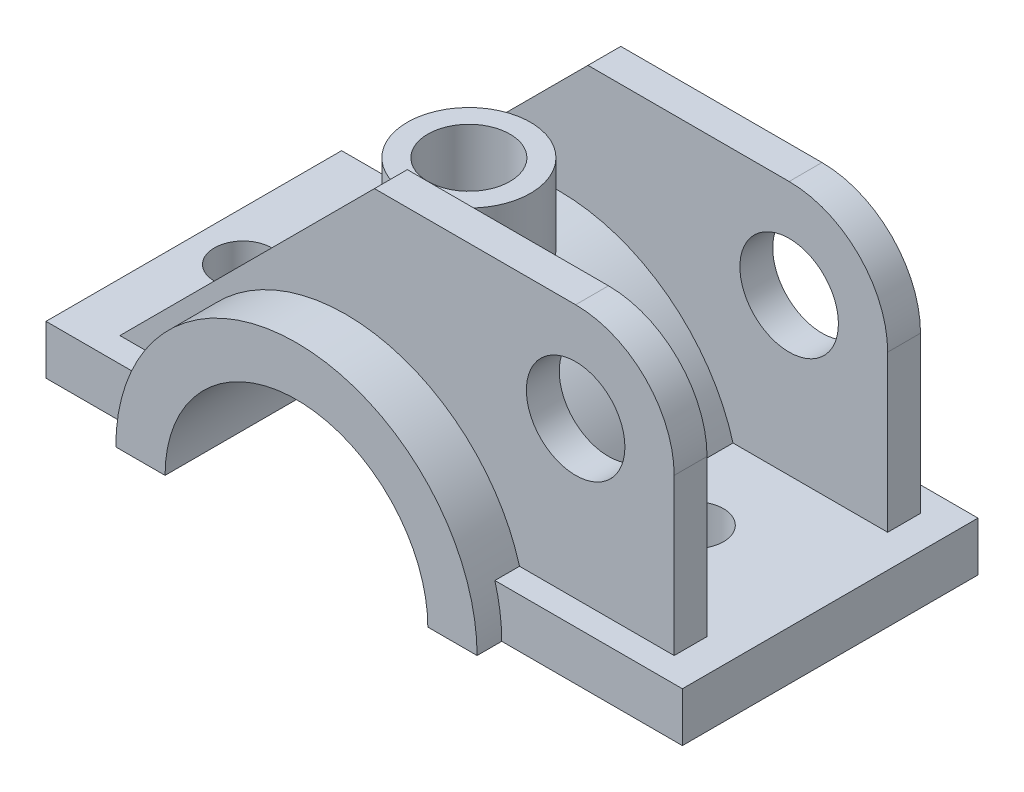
ISO-10303-21;
HEADER;
FILE_DESCRIPTION(('STEP AP214'),'2;1');
FILE_NAME('part.step','',(''),(''),'','','');
FILE_SCHEMA(('AUTOMOTIVE_DESIGN { 1 0 10303 214 1 1 1 1 }'));
ENDSEC;
DATA;
#1=APPLICATION_CONTEXT('core data for automotive mechanical design processes');
#2=APPLICATION_PROTOCOL_DEFINITION('international standard','automotive_design',2000,#1);
#3=PRODUCT_CONTEXT('',#1,'mechanical');
#4=PRODUCT('Part','Part','',(#3));
#5=PRODUCT_RELATED_PRODUCT_CATEGORY('part','',(#4));
#6=PRODUCT_DEFINITION_FORMATION('','',#4);
#7=PRODUCT_DEFINITION_CONTEXT('part definition',#1,'design');
#8=PRODUCT_DEFINITION('design','',#6,#7);
#9=PRODUCT_DEFINITION_SHAPE('','',#8);
#10=(LENGTH_UNIT() NAMED_UNIT(*) SI_UNIT(.MILLI.,.METRE.));
#11=(NAMED_UNIT(*) PLANE_ANGLE_UNIT() SI_UNIT($,.RADIAN.));
#12=(NAMED_UNIT(*) SI_UNIT($,.STERADIAN.) SOLID_ANGLE_UNIT());
#13=UNCERTAINTY_MEASURE_WITH_UNIT(LENGTH_MEASURE(1.E-05),#10,'distance_accuracy_value','');
#14=(GEOMETRIC_REPRESENTATION_CONTEXT(3) GLOBAL_UNCERTAINTY_ASSIGNED_CONTEXT((#13)) GLOBAL_UNIT_ASSIGNED_CONTEXT((#10,
#11,#12)) REPRESENTATION_CONTEXT('',''));
#15=CARTESIAN_POINT('',(0.,0.,0.));
#16=DIRECTION('',(0.,0.,1.));
#17=DIRECTION('',(1.,0.,0.));
#18=AXIS2_PLACEMENT_3D('',#15,#16,#17);
#19=CARTESIAN_POINT('',(0.,0.,-42.));
#20=DIRECTION('',(0.,0.,1.));
#21=DIRECTION('',(1.,0.,0.));
#22=AXIS2_PLACEMENT_3D('',#19,#20,#21);
#23=CYLINDRICAL_SURFACE('',#22,44.);
#24=CARTESIAN_POINT('',(0.,44.0000000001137,15.));
#25=CARTESIAN_POINT('',(0.408690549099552,44.0000002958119,15.0000004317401));
#26=CARTESIAN_POINT('',(0.817374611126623,43.9942929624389,14.983283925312));
#27=CARTESIAN_POINT('',(1.63169489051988,43.9716212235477,14.9165832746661));
#28=CARTESIAN_POINT('',(2.0373311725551,43.9546570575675,14.866599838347));
#29=CARTESIAN_POINT('',(2.84260455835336,43.9099332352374,14.7338431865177));
#30=CARTESIAN_POINT('',(3.24224144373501,43.8821731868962,14.6510687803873));
#31=CARTESIAN_POINT('',(4.03267054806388,43.8166047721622,14.4534953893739));
#32=CARTESIAN_POINT('',(4.42346267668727,43.7787963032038,14.3386960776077));
#33=CARTESIAN_POINT('',(5.19286289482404,43.6942068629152,14.0783108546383));
#34=CARTESIAN_POINT('',(5.57149124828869,43.647441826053,13.9327795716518));
#35=CARTESIAN_POINT('',(6.31484569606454,43.5461072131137,13.6120020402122));
#36=CARTESIAN_POINT('',(6.67957184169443,43.4915376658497,13.4367559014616));
#37=CARTESIAN_POINT('',(7.39289222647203,43.3759807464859,13.0578804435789));
#38=CARTESIAN_POINT('',(7.74148660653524,43.3149934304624,12.854251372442));
#39=CARTESIAN_POINT('',(8.42063313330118,43.1881041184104,12.4199624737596));
#40=CARTESIAN_POINT('',(8.75117873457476,43.1222003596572,12.1892929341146));
#41=CARTESIAN_POINT('',(9.40259278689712,42.9849462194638,11.6946085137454));
#42=CARTESIAN_POINT('',(9.72280361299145,42.9134886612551,11.4297571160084));
#43=CARTESIAN_POINT('',(10.3399723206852,42.768977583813,10.8746151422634));
#44=CARTESIAN_POINT('',(10.6369296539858,42.6959240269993,10.5843239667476));
#45=CARTESIAN_POINT('',(11.2059200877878,42.5501311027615,9.97996340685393));
#46=CARTESIAN_POINT('',(11.4779432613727,42.4773918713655,9.66588464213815));
#47=CARTESIAN_POINT('',(11.9951460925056,42.3342469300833,9.01603378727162));
#48=CARTESIAN_POINT('',(12.240334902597,42.2638404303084,8.68026915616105));
#49=CARTESIAN_POINT('',(12.7094240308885,42.1251966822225,7.97835293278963));
#50=CARTESIAN_POINT('',(12.9324441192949,42.0570915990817,7.61158610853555));
#51=CARTESIAN_POINT('',(13.3466642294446,41.9274811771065,6.85936632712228));
#52=CARTESIAN_POINT('',(13.5378634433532,41.8659760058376,6.47391289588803));
#53=CARTESIAN_POINT('',(13.8867920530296,41.7515357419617,5.68701926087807));
#54=CARTESIAN_POINT('',(14.044529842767,41.698598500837,5.28558309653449));
#55=CARTESIAN_POINT('',(14.3251392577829,41.6030333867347,4.46951173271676));
#56=CARTESIAN_POINT('',(14.4480125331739,41.5604050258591,4.05487715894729));
#57=CARTESIAN_POINT('',(14.6539983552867,41.4882131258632,3.23025779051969));
#58=CARTESIAN_POINT('',(14.7383524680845,41.4582443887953,2.82061854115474));
#59=CARTESIAN_POINT('',(14.8726161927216,41.4102691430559,1.9950366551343));
#60=CARTESIAN_POINT('',(14.9225265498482,41.3922623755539,1.57909415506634));
#61=CARTESIAN_POINT('',(14.98737229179,41.3688272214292,0.744254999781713));
#62=CARTESIAN_POINT('',(15.0023175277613,41.3633952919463,0.325359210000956));
#63=CARTESIAN_POINT('',(14.997100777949,41.3652871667,-0.512178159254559));
#64=CARTESIAN_POINT('',(14.9769398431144,41.3726105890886,-0.930819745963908));
#65=CARTESIAN_POINT('',(14.9035449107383,41.3991034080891,-1.74444374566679));
#66=CARTESIAN_POINT('',(14.8519505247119,41.417685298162,-2.13959456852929));
#67=CARTESIAN_POINT('',(14.7176470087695,41.46559951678,-2.92389254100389));
#68=CARTESIAN_POINT('',(14.6349390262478,41.4949314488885,-3.31303991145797));
#69=CARTESIAN_POINT('',(14.4391437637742,41.5634679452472,-4.08275010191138));
#70=CARTESIAN_POINT('',(14.3260538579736,41.6026733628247,-4.46331217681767));
#71=CARTESIAN_POINT('',(14.0704495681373,41.6898148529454,-5.21339145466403));
#72=CARTESIAN_POINT('',(13.9279343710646,41.7377511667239,-5.58290835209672));
#73=CARTESIAN_POINT('',(13.611988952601,41.8418673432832,-6.31468243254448));
#74=CARTESIAN_POINT('',(13.4380848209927,41.8981708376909,-6.67671728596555));
#75=CARTESIAN_POINT('',(13.0623027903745,42.0168424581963,-7.38491336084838));
#76=CARTESIAN_POINT('',(12.860424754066,42.0792106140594,-7.73107450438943));
#77=CARTESIAN_POINT('',(12.4300433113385,42.2083461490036,-8.40559879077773));
#78=CARTESIAN_POINT('',(12.2015376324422,42.2751139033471,-8.73396041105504));
#79=CARTESIAN_POINT('',(11.7192629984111,42.4113389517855,-9.37115757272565));
#80=CARTESIAN_POINT('',(11.4654850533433,42.4807971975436,-9.67998610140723));
#81=CARTESIAN_POINT('',(10.9196888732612,42.6244565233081,-10.2926066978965));
#82=CARTESIAN_POINT('',(10.6263388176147,42.6987093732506,-10.5952014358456));
#83=CARTESIAN_POINT('',(10.0150815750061,42.8462014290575,-11.174772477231));
#84=CARTESIAN_POINT('',(9.69717327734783,42.9194405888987,-11.451747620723));
#85=CARTESIAN_POINT('',(9.03865118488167,43.0629348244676,-11.9783373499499));
#86=CARTESIAN_POINT('',(8.69803070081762,43.1331890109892,-12.2279438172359));
#87=CARTESIAN_POINT('',(7.99640207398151,43.2687549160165,-12.6978643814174));
#88=CARTESIAN_POINT('',(7.63540168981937,43.3340684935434,-12.9181895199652));
#89=CARTESIAN_POINT('',(6.89109222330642,43.4586788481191,-13.3302579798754));
#90=CARTESIAN_POINT('',(6.50758076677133,43.5179011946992,-13.521658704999));
#91=CARTESIAN_POINT('',(5.72453824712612,43.6278116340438,-13.8713196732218));
#92=CARTESIAN_POINT('',(5.32500696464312,43.6784996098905,-14.0295794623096));
#93=CARTESIAN_POINT('',(4.51291866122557,43.7698578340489,-14.3114723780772));
#94=CARTESIAN_POINT('',(4.10036552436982,43.8105310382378,-14.4351157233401));
#95=CARTESIAN_POINT('',(3.26525796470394,43.8806748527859,-14.6466240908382));
#96=CARTESIAN_POINT('',(2.84270402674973,43.9101460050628,-14.7344908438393));
#97=CARTESIAN_POINT('',(2.01017126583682,43.9559451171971,-14.8704070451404));
#98=CARTESIAN_POINT('',(1.60048523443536,43.9728060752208,-14.920074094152));
#99=CARTESIAN_POINT('',(0.778106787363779,43.9950420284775,-14.9854822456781));
#100=CARTESIAN_POINT('',(0.365414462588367,44.0004173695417,-15.0012243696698));
#101=CARTESIAN_POINT('',(-0.459782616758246,43.9995320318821,-14.9986272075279));
#102=CARTESIAN_POINT('',(-0.87228739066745,43.9932731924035,-14.9802933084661));
#103=CARTESIAN_POINT('',(-1.69404783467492,43.9692979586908,-14.9097371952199));
#104=CARTESIAN_POINT('',(-2.10330354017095,43.9515816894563,-14.8575153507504));
#105=CARTESIAN_POINT('',(-2.90306705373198,43.9058961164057,-14.7218087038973));
#106=CARTESIAN_POINT('',(-3.29376518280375,43.8782574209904,-14.6393302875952));
#107=CARTESIAN_POINT('',(-4.06658728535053,43.8133910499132,-14.4437440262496));
#108=CARTESIAN_POINT('',(-4.44871148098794,43.7761636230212,-14.3306369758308));
#109=CARTESIAN_POINT('',(-5.2019418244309,43.6930589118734,-14.0747303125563));
#110=CARTESIAN_POINT('',(-5.5730470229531,43.647180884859,-13.9319281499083));
#111=CARTESIAN_POINT('',(-6.30191922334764,43.5479174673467,-13.6177574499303));
#112=CARTESIAN_POINT('',(-6.65968583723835,43.4945318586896,-13.4463880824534));
#113=CARTESIAN_POINT('',(-7.36920292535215,43.3800350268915,-13.0713492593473));
#114=CARTESIAN_POINT('',(-7.72053196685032,43.3187544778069,-12.8669342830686));
#115=CARTESIAN_POINT('',(-8.40481789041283,43.1912050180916,-12.4307551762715));
#116=CARTESIAN_POINT('',(-8.73777452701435,43.1249360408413,-12.1989906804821));
#117=CARTESIAN_POINT('',(-9.38342817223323,42.9890698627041,-11.7096272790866));
#118=CARTESIAN_POINT('',(-9.69612408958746,42.9194724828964,-11.4520269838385));
#119=CARTESIAN_POINT('',(-10.2996098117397,42.7786641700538,-10.9124677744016));
#120=CARTESIAN_POINT('',(-10.5903893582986,42.7074525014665,-10.6304975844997));
#121=CARTESIAN_POINT('',(-11.1615450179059,42.5618476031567,-10.0299410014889));
#122=CARTESIAN_POINT('',(-11.4407631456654,42.4874646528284,-9.71024954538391));
#123=CARTESIAN_POINT('',(-11.971230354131,42.3410597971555,-9.04817683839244));
#124=CARTESIAN_POINT('',(-12.2224914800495,42.2690368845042,-8.7058054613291));
#125=CARTESIAN_POINT('',(-12.6955221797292,42.1293789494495,-8.00025916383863));
#126=CARTESIAN_POINT('',(-12.9172834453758,42.061745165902,-7.63707842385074));
#127=CARTESIAN_POINT('',(-13.32956603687,41.9329147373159,-6.89230188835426));
#128=CARTESIAN_POINT('',(-13.5200879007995,41.8717179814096,-6.51070641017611));
#129=CARTESIAN_POINT('',(-13.8681406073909,41.7577322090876,-5.73204407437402));
#130=CARTESIAN_POINT('',(-14.025707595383,41.7049339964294,-5.33499473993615));
#131=CARTESIAN_POINT('',(-14.3066991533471,41.6093788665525,-4.52780039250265));
#132=CARTESIAN_POINT('',(-14.4301235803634,41.5666219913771,-4.11765532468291));
#133=CARTESIAN_POINT('',(-14.6415782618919,41.4926108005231,-3.28748829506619));
#134=CARTESIAN_POINT('',(-14.7296226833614,41.4613518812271,-2.86747035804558));
#135=CARTESIAN_POINT('',(-14.8694600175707,41.4114078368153,-2.0207095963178));
#136=CARTESIAN_POINT('',(-14.9212548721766,41.3927220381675,-1.59396713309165));
#137=CARTESIAN_POINT('',(-14.9862375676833,41.3692372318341,-0.76026863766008));
#138=CARTESIAN_POINT('',(-15.0013495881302,41.3637462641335,-0.353480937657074));
#139=CARTESIAN_POINT('',(-14.9984614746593,41.364793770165,0.459952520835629));
#140=CARTESIAN_POINT('',(-14.9804625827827,41.3713317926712,0.866598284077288));
#141=CARTESIAN_POINT('',(-14.9115377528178,41.396224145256,1.67669012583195));
#142=CARTESIAN_POINT('',(-14.8606140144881,41.4145776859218,2.08013641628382));
#143=CARTESIAN_POINT('',(-14.726342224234,41.4625121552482,2.8809139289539));
#144=CARTESIAN_POINT('',(-14.642994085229,41.4920931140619,3.27824513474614));
#145=CARTESIAN_POINT('',(-14.4467287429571,41.5608299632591,4.0557917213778));
#146=CARTESIAN_POINT('',(-14.3344647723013,41.5997731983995,4.43619124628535));
#147=CARTESIAN_POINT('',(-14.0805531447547,41.6864006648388,5.18600999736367));
#148=CARTESIAN_POINT('',(-13.9389060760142,41.7340847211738,5.55542944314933));
#149=CARTESIAN_POINT('',(-13.6273297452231,41.8368590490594,6.28106677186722));
#150=CARTESIAN_POINT('',(-13.4574001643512,41.891949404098,6.63728450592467));
#151=CARTESIAN_POINT('',(-13.0904138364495,42.0080718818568,7.33460054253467));
#152=CARTESIAN_POINT('',(-12.8933473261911,42.0691061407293,7.67569334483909));
#153=CARTESIAN_POINT('',(-12.4639485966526,42.1983706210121,8.35577126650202));
#154=CARTESIAN_POINT('',(-12.2304267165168,42.266801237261,8.69396751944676));
#155=CARTESIAN_POINT('',(-11.7367560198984,42.4065366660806,9.34970593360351));
#156=CARTESIAN_POINT('',(-11.4766062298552,42.4778415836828,9.66724733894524));
#157=CARTESIAN_POINT('',(-10.9311766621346,42.62146079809,10.2799646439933));
#158=CARTESIAN_POINT('',(-10.6458862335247,42.6937755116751,10.5751309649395));
#159=CARTESIAN_POINT('',(-10.052060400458,42.8374761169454,11.1411073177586));
#160=CARTESIAN_POINT('',(-9.74353257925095,42.9088623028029,11.4119252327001));
#161=CARTESIAN_POINT('',(-9.09159886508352,43.05181479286,11.9384091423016));
#162=CARTESIAN_POINT('',(-8.74727484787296,43.1232643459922,12.1929715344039));
#163=CARTESIAN_POINT('',(-8.0374174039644,43.261190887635,12.6721467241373));
#164=CARTESIAN_POINT('',(-7.67188326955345,43.3276677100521,12.8967585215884));
#165=CARTESIAN_POINT('',(-6.9220527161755,43.4537648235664,13.314251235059));
#166=CARTESIAN_POINT('',(-6.53775910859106,43.5133861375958,13.5071368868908));
#167=CARTESIAN_POINT('',(-5.75299624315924,43.6240761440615,13.8595825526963));
#168=CARTESIAN_POINT('',(-5.35252764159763,43.675145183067,14.019143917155));
#169=CARTESIAN_POINT('',(-4.55031702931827,43.7658853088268,14.29929228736));
#170=CARTESIAN_POINT('',(-4.14896105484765,43.8058481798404,14.4208901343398));
#171=CARTESIAN_POINT('',(-3.33660869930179,43.8752002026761,14.6302070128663));
#172=CARTESIAN_POINT('',(-2.92561250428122,43.9045895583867,14.7179266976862));
#173=CARTESIAN_POINT('',(-2.09716879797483,43.9519507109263,14.8586124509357));
#174=CARTESIAN_POINT('',(-1.6797229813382,43.9699254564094,14.9115874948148));
#175=CARTESIAN_POINT('',(-0.841515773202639,43.9939498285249,14.9822806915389));
#176=CARTESIAN_POINT('',(-0.420754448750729,43.9999996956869,14.9999995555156));
#177=CARTESIAN_POINT('',(0.,44.0000000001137,15.));
#178=B_SPLINE_CURVE_WITH_KNOTS('',3,(#24,#25,#26,#27,#28,#29,#30,#31,#32,#33,#34,#35,#36,#37,
#38,#39,#40,#41,#42,#43,#44,#45,#46,#47,#48,#49,#50,#51,#52,#53,#54,#55,#56,#57,#58,#59,#60,#61,
#62,#63,#64,#65,#66,#67,#68,#69,#70,#71,#72,#73,#74,#75,#76,#77,#78,#79,#80,#81,#82,#83,#84,#85,
#86,#87,#88,#89,#90,#91,#92,#93,#94,#95,#96,#97,#98,#99,#100,#101,#102,#103,#104,#105,#106,#107,
#108,#109,#110,#111,#112,#113,#114,#115,#116,#117,#118,#119,#120,#121,#122,#123,#124,#125,#126,
#127,#128,#129,#130,#131,#132,#133,#134,#135,#136,#137,#138,#139,#140,#141,#142,#143,#144,#145,
#146,#147,#148,#149,#150,#151,#152,#153,#154,#155,#156,#157,#158,#159,#160,#161,#162,#163,#164,
#165,#166,#167,#168,#169,#170,#171,#172,#173,#174,#175,#176,#177),.UNSPECIFIED.,.T.,.F.,(4,2,2,
2,2,2,2,2,2,2,2,2,2,2,2,2,2,2,2,2,2,2,2,2,2,2,2,2,2,2,2,2,2,2,2,2,2,2,2,2,2,2,2,2,2,2,2,2,2,2,2,
2,2,2,2,2,2,2,2,2,2,2,2,2,2,2,2,2,2,2,2,2,2,2,2,2,4),(0.,1.22568067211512,2.45133526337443,
3.67703436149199,4.90274597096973,6.12629686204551,7.34984323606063,8.57337892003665,
9.79735541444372,11.0608741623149,12.3244226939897,13.5884721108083,14.8520890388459,
16.1543453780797,17.4566347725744,18.7585970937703,20.0604977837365,21.3168127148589,
22.5731004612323,23.8290342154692,25.0849303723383,26.2803407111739,27.4757069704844,
28.671176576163,29.8666792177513,31.0820268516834,32.2973804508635,33.5128378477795,
34.7287291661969,36.0110605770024,37.2934500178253,38.5762188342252,39.858502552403,
41.1549503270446,42.4514158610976,43.7474982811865,45.0435179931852,46.2810643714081,
47.5185734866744,48.7558869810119,49.9931869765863,51.1925953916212,52.3919726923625,
53.5914530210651,54.790968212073,56.0227842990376,57.2546168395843,58.4865156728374,
59.7189875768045,61.0102527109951,62.3009593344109,63.5920286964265,64.8830758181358,
66.1726993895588,67.462328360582,68.7514404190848,70.0404834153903,71.2602914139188,
72.4800536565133,73.699734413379,74.9194184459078,76.1136541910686,77.3078660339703,
78.5020913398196,79.6967474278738,80.9452833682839,82.1938649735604,83.4429781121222,
84.6916853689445,85.9924916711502,87.293341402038,88.5939967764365,89.8945994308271,
91.1568362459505,92.4190487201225,93.6809350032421,94.9427958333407),.UNSPECIFIED.);
#179=CARTESIAN_POINT('',(0.,44.0000000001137,15.));
#180=VERTEX_POINT('',#179);
#181=EDGE_CURVE('E12',#180,#180,#178,.T.);
#182=ORIENTED_EDGE('',*,*,#181,.F.);
#183=EDGE_LOOP('',(#182));
#184=FACE_BOUND('',#183,.T.);
#185=DIRECTION('',(0.,0.,1.));
#186=VECTOR('',#185,1.);
#187=CARTESIAN_POINT('',(42.3320209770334,12.,-42.));
#188=LINE('',#187,#186);
#189=CARTESIAN_POINT('',(42.3320209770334,12.,22.));
#190=VERTEX_POINT('',#189);
#191=CARTESIAN_POINT('',(42.3320209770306,12.0000000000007,-22.));
#192=VERTEX_POINT('',#191);
#193=EDGE_CURVE('E226',#190,#192,#188,.F.);
#194=ORIENTED_EDGE('',*,*,#193,.T.);
#195=CARTESIAN_POINT('',(0.,0.,-22.));
#196=DIRECTION('',(0.,0.,-1.));
#197=DIRECTION('',(1.,0.,0.));
#198=AXIS2_PLACEMENT_3D('',#195,#196,#197);
#199=CIRCLE('',#198,43.9999999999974);
#200=CARTESIAN_POINT('',(-42.3320209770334,12.,-22.));
#201=VERTEX_POINT('',#200);
#202=EDGE_CURVE('E212',#201,#192,#199,.T.);
#203=ORIENTED_EDGE('',*,*,#202,.F.);
#204=DIRECTION('',(0.,0.,1.));
#205=VECTOR('',#204,1.);
#206=CARTESIAN_POINT('',(-42.3320209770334,12.,-42.));
#207=LINE('',#206,#205);
#208=CARTESIAN_POINT('',(-42.3320209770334,12.,22.));
#209=VERTEX_POINT('',#208);
#210=EDGE_CURVE('E262',#209,#201,#207,.F.);
#211=ORIENTED_EDGE('',*,*,#210,.F.);
#212=CARTESIAN_POINT('',(0.,0.,22.));
#213=DIRECTION('',(0.,0.,-1.));
#214=DIRECTION('',(1.,0.,0.));
#215=AXIS2_PLACEMENT_3D('',#212,#213,#214);
#216=CIRCLE('',#215,43.9999999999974);
#217=EDGE_CURVE('E234',#209,#190,#216,.T.);
#218=ORIENTED_EDGE('',*,*,#217,.T.);
#219=EDGE_LOOP('',(#194,#203,#211,#218));
#220=FACE_BOUND('',#219,.T.);
#221=ADVANCED_FACE('F37',(#184,#220),#23,.T.);
#222=CARTESIAN_POINT('',(500000.,12.,36.));
#223=DIRECTION('',(0.,-1.,0.));
#224=DIRECTION('',(0.,0.,-1.));
#225=AXIS2_PLACEMENT_3D('',#222,#223,#224);
#226=PLANE('',#225);
#227=CARTESIAN_POINT('',(-55.0000000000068,12.,0.));
#228=DIRECTION('',(0.,1.,0.));
#229=DIRECTION('',(0.,0.,1.));
#230=AXIS2_PLACEMENT_3D('',#227,#228,#229);
#231=CIRCLE('',#230,7.00000000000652);
#232=CARTESIAN_POINT('',(-55.0000000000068,12.,7.00000000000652));
#233=VERTEX_POINT('',#232);
#234=EDGE_CURVE('E453',#233,#233,#231,.T.);
#235=ORIENTED_EDGE('',*,*,#234,.F.);
#236=EDGE_LOOP('',(#235));
#237=FACE_BOUND('',#236,.T.);
#238=DIRECTION('',(1.,0.,0.));
#239=VECTOR('',#238,1.);
#240=CARTESIAN_POINT('',(-55.,12.,-22.));
#241=LINE('',#240,#239);
#242=CARTESIAN_POINT('',(-55.,12.,-22.));
#243=VERTEX_POINT('',#242);
#244=EDGE_CURVE('E216',#243,#201,#241,.T.);
#245=ORIENTED_EDGE('',*,*,#244,.F.);
#246=DIRECTION('',(0.,0.,-1.));
#247=VECTOR('',#246,1.);
#248=CARTESIAN_POINT('',(-55.,12.,-22.));
#249=LINE('',#248,#247);
#250=CARTESIAN_POINT('',(-55.,12.,-30.));
#251=VERTEX_POINT('',#250);
#252=EDGE_CURVE('E409',#243,#251,#249,.T.);
#253=ORIENTED_EDGE('',*,*,#252,.T.);
#254=DIRECTION('',(1.,0.,0.));
#255=VECTOR('',#254,1.);
#256=CARTESIAN_POINT('',(-55.,12.,-30.));
#257=LINE('',#256,#255);
#258=CARTESIAN_POINT('',(-42.3320209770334,12.,-30.));
#259=VERTEX_POINT('',#258);
#260=EDGE_CURVE('E430',#251,#259,#257,.T.);
#261=ORIENTED_EDGE('',*,*,#260,.T.);
#262=CARTESIAN_POINT('',(-42.3320209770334,12.,-36.));
#263=VERTEX_POINT('',#262);
#264=EDGE_CURVE('E263',#259,#263,#207,.F.);
#265=ORIENTED_EDGE('',*,*,#264,.T.);
#266=DIRECTION('',(-1.,0.,0.));
#267=VECTOR('',#266,1.);
#268=CARTESIAN_POINT('',(500000.,12.,-36.));
#269=LINE('',#268,#267);
#270=CARTESIAN_POINT('',(-67.,12.,-36.));
#271=VERTEX_POINT('',#270);
#272=EDGE_CURVE('E272',#263,#271,#269,.T.);
#273=ORIENTED_EDGE('',*,*,#272,.T.);
#274=DIRECTION('',(0.,0.,1.));
#275=VECTOR('',#274,1.);
#276=CARTESIAN_POINT('',(-67.,12.,36.));
#277=LINE('',#276,#275);
#278=CARTESIAN_POINT('',(-67.,12.,36.));
#279=VERTEX_POINT('',#278);
#280=EDGE_CURVE('E248',#271,#279,#277,.T.);
#281=ORIENTED_EDGE('',*,*,#280,.T.);
#282=DIRECTION('',(-1.,0.,0.));
#283=VECTOR('',#282,1.);
#284=CARTESIAN_POINT('',(500000.,12.,36.));
#285=LINE('',#284,#283);
#286=CARTESIAN_POINT('',(-42.3320209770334,12.,36.));
#287=VERTEX_POINT('',#286);
#288=EDGE_CURVE('E251',#287,#279,#285,.T.);
#289=ORIENTED_EDGE('',*,*,#288,.F.);
#290=CARTESIAN_POINT('',(-42.3320209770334,12.,30.));
#291=VERTEX_POINT('',#290);
#292=EDGE_CURVE('E258',#287,#291,#207,.F.);
#293=ORIENTED_EDGE('',*,*,#292,.T.);
#294=DIRECTION('',(1.,0.,0.));
#295=VECTOR('',#294,1.);
#296=CARTESIAN_POINT('',(-55.,12.,30.));
#297=LINE('',#296,#295);
#298=CARTESIAN_POINT('',(-55.0000000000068,12.,30.));
#299=VERTEX_POINT('',#298);
#300=EDGE_CURVE('E369',#299,#291,#297,.T.);
#301=ORIENTED_EDGE('',*,*,#300,.F.);
#302=DIRECTION('',(0.,0.,1.));
#303=VECTOR('',#302,1.);
#304=CARTESIAN_POINT('',(-55.,12.,22.));
#305=LINE('',#304,#303);
#306=CARTESIAN_POINT('',(-55.0000000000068,12.,22.));
#307=VERTEX_POINT('',#306);
#308=EDGE_CURVE('E64',#307,#299,#305,.T.);
#309=ORIENTED_EDGE('',*,*,#308,.F.);
#310=DIRECTION('',(1.,0.,0.));
#311=VECTOR('',#310,1.);
#312=CARTESIAN_POINT('',(-55.,12.,22.));
#313=LINE('',#312,#311);
#314=EDGE_CURVE('E389',#307,#209,#313,.T.);
#315=ORIENTED_EDGE('',*,*,#314,.T.);
#316=ORIENTED_EDGE('',*,*,#210,.T.);
#317=EDGE_LOOP('',(#245,#253,#261,#265,#273,#281,#289,#293,#301,#309,#315,#316));
#318=FACE_BOUND('',#317,.T.);
#319=ADVANCED_FACE('F558',(#237,#318),#226,.F.);
#320=CARTESIAN_POINT('',(-500000.,12.,36.));
#321=DIRECTION('',(0.,1.,0.));
#322=DIRECTION('',(0.,0.,1.));
#323=AXIS2_PLACEMENT_3D('',#320,#321,#322);
#324=PLANE('',#323);
#325=CARTESIAN_POINT('',(54.9999999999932,12.,0.));
#326=DIRECTION('',(0.,1.,0.));
#327=DIRECTION('',(0.,0.,1.));
#328=AXIS2_PLACEMENT_3D('',#325,#326,#327);
#329=CIRCLE('',#328,7.);
#330=CARTESIAN_POINT('',(54.9999999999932,12.,7.));
#331=VERTEX_POINT('',#330);
#332=EDGE_CURVE('E459',#331,#331,#329,.T.);
#333=ORIENTED_EDGE('',*,*,#332,.F.);
#334=EDGE_LOOP('',(#333));
#335=FACE_BOUND('',#334,.T.);
#336=DIRECTION('',(0.,0.,-1.));
#337=VECTOR('',#336,1.);
#338=CARTESIAN_POINT('',(80.,12.,-22.));
#339=LINE('',#338,#337);
#340=CARTESIAN_POINT('',(79.9999999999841,12.,-22.));
#341=VERTEX_POINT('',#340);
#342=CARTESIAN_POINT('',(80.,12.,-30.));
#343=VERTEX_POINT('',#342);
#344=EDGE_CURVE('E230',#341,#343,#339,.T.);
#345=ORIENTED_EDGE('',*,*,#344,.F.);
#346=DIRECTION('',(1.,0.,0.));
#347=VECTOR('',#346,1.);
#348=CARTESIAN_POINT('',(80.,12.,-22.));
#349=LINE('',#348,#347);
#350=EDGE_CURVE('E56',#192,#341,#349,.T.);
#351=ORIENTED_EDGE('',*,*,#350,.F.);
#352=ORIENTED_EDGE('',*,*,#193,.F.);
#353=DIRECTION('',(1.,0.,0.));
#354=VECTOR('',#353,1.);
#355=CARTESIAN_POINT('',(80.,12.,22.));
#356=LINE('',#355,#354);
#357=CARTESIAN_POINT('',(79.9999999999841,12.,22.));
#358=VERTEX_POINT('',#357);
#359=EDGE_CURVE('E368',#190,#358,#356,.T.);
#360=ORIENTED_EDGE('',*,*,#359,.T.);
#361=DIRECTION('',(0.,0.,1.));
#362=VECTOR('',#361,1.);
#363=CARTESIAN_POINT('',(80.,12.,22.));
#364=LINE('',#363,#362);
#365=CARTESIAN_POINT('',(80.,12.,30.));
#366=VERTEX_POINT('',#365);
#367=EDGE_CURVE('E357',#358,#366,#364,.T.);
#368=ORIENTED_EDGE('',*,*,#367,.T.);
#369=DIRECTION('',(1.,0.,0.));
#370=VECTOR('',#369,1.);
#371=CARTESIAN_POINT('',(80.,12.,30.));
#372=LINE('',#371,#370);
#373=CARTESIAN_POINT('',(42.3320209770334,12.,30.));
#374=VERTEX_POINT('',#373);
#375=EDGE_CURVE('E384',#374,#366,#372,.T.);
#376=ORIENTED_EDGE('',*,*,#375,.F.);
#377=CARTESIAN_POINT('',(42.3320209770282,12.,36.));
#378=VERTEX_POINT('',#377);
#379=EDGE_CURVE('E235',#378,#374,#188,.F.);
#380=ORIENTED_EDGE('',*,*,#379,.F.);
#381=DIRECTION('',(1.,0.,0.));
#382=VECTOR('',#381,1.);
#383=CARTESIAN_POINT('',(-500000.,12.,36.));
#384=LINE('',#383,#382);
#385=CARTESIAN_POINT('',(88.,12.,36.));
#386=VERTEX_POINT('',#385);
#387=EDGE_CURVE('E339',#378,#386,#384,.T.);
#388=ORIENTED_EDGE('',*,*,#387,.T.);
#389=DIRECTION('',(0.,0.,1.));
#390=VECTOR('',#389,1.);
#391=CARTESIAN_POINT('',(88.,12.,36.));
#392=LINE('',#391,#390);
#393=CARTESIAN_POINT('',(88.,12.,-36.));
#394=VERTEX_POINT('',#393);
#395=EDGE_CURVE('E341',#394,#386,#392,.T.);
#396=ORIENTED_EDGE('',*,*,#395,.F.);
#397=DIRECTION('',(1.,0.,0.));
#398=VECTOR('',#397,1.);
#399=CARTESIAN_POINT('',(-500000.,12.,-36.));
#400=LINE('',#399,#398);
#401=CARTESIAN_POINT('',(42.3320209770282,12.,-36.));
#402=VERTEX_POINT('',#401);
#403=EDGE_CURVE('E337',#402,#394,#400,.T.);
#404=ORIENTED_EDGE('',*,*,#403,.F.);
#405=CARTESIAN_POINT('',(42.3320209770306,12.0000000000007,-30.));
#406=VERTEX_POINT('',#405);
#407=EDGE_CURVE('E236',#406,#402,#188,.F.);
#408=ORIENTED_EDGE('',*,*,#407,.F.);
#409=DIRECTION('',(1.,0.,0.));
#410=VECTOR('',#409,1.);
#411=CARTESIAN_POINT('',(80.,12.,-30.));
#412=LINE('',#411,#410);
#413=EDGE_CURVE('E436',#406,#343,#412,.T.);
#414=ORIENTED_EDGE('',*,*,#413,.T.);
#415=EDGE_LOOP('',(#345,#351,#352,#360,#368,#376,#380,#388,#396,#404,#408,#414));
#416=FACE_BOUND('',#415,.T.);
#417=ADVANCED_FACE('F225',(#335,#416),#324,.T.);
#418=CARTESIAN_POINT('',(0.,0.,-30.));
#419=DIRECTION('',(0.,0.,-1.));
#420=DIRECTION('',(1.,0.,0.));
#421=AXIS2_PLACEMENT_3D('',#418,#419,#420);
#422=CIRCLE('',#421,43.9999999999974);
#423=EDGE_CURVE('E433',#259,#406,#422,.T.);
#424=ORIENTED_EDGE('',*,*,#423,.T.);
#425=ORIENTED_EDGE('',*,*,#407,.T.);
#426=CARTESIAN_POINT('',(0.,0.,-36.));
#427=DIRECTION('',(0.,0.,-1.));
#428=DIRECTION('',(-1.,0.,0.));
#429=AXIS2_PLACEMENT_3D('',#426,#427,#428);
#430=CIRCLE('',#429,44.);
#431=CARTESIAN_POINT('',(44.,0.,-36.));
#432=VERTEX_POINT('',#431);
#433=EDGE_CURVE('E239',#402,#432,#430,.T.);
#434=ORIENTED_EDGE('',*,*,#433,.T.);
#435=DIRECTION('',(0.,0.,1.));
#436=VECTOR('',#435,1.);
#437=CARTESIAN_POINT('',(44.,0.,-42.));
#438=LINE('',#437,#436);
#439=CARTESIAN_POINT('',(44.,0.,-42.));
#440=VERTEX_POINT('',#439);
#441=EDGE_CURVE('E49',#440,#432,#438,.T.);
#442=ORIENTED_EDGE('',*,*,#441,.F.);
#443=CARTESIAN_POINT('',(0.,0.,-42.));
#444=DIRECTION('',(0.,0.,1.));
#445=DIRECTION('',(1.,0.,0.));
#446=AXIS2_PLACEMENT_3D('',#443,#444,#445);
#447=CIRCLE('',#446,44.);
#448=CARTESIAN_POINT('',(-44.,0.,-42.));
#449=VERTEX_POINT('',#448);
#450=EDGE_CURVE('E277',#440,#449,#447,.T.);
#451=ORIENTED_EDGE('',*,*,#450,.T.);
#452=DIRECTION('',(0.,0.,1.));
#453=VECTOR('',#452,1.);
#454=CARTESIAN_POINT('',(-44.,0.,-42.));
#455=LINE('',#454,#453);
#456=CARTESIAN_POINT('',(-44.,0.,-36.));
#457=VERTEX_POINT('',#456);
#458=EDGE_CURVE('E307',#449,#457,#455,.T.);
#459=ORIENTED_EDGE('',*,*,#458,.T.);
#460=CARTESIAN_POINT('',(0.,0.,-36.));
#461=DIRECTION('',(0.,0.,1.));
#462=DIRECTION('',(1.,0.,0.));
#463=AXIS2_PLACEMENT_3D('',#460,#461,#462);
#464=CIRCLE('',#463,44.);
#465=EDGE_CURVE('E264',#263,#457,#464,.T.);
#466=ORIENTED_EDGE('',*,*,#465,.F.);
#467=ORIENTED_EDGE('',*,*,#264,.F.);
#468=EDGE_LOOP('',(#424,#425,#434,#442,#451,#459,#466,#467));
#469=FACE_BOUND('',#468,.T.);
#470=ADVANCED_FACE('F557',(#469),#23,.T.);
#471=CARTESIAN_POINT('',(0.,0.,30.));
#472=DIRECTION('',(0.,0.,-1.));
#473=DIRECTION('',(1.,0.,0.));
#474=AXIS2_PLACEMENT_3D('',#471,#472,#473);
#475=CIRCLE('',#474,43.9999999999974);
#476=EDGE_CURVE('E366',#291,#374,#475,.T.);
#477=ORIENTED_EDGE('',*,*,#476,.F.);
#478=ORIENTED_EDGE('',*,*,#292,.F.);
#479=CARTESIAN_POINT('',(0.,0.,36.));
#480=DIRECTION('',(0.,0.,-1.));
#481=DIRECTION('',(-1.,0.,0.));
#482=AXIS2_PLACEMENT_3D('',#479,#480,#481);
#483=CIRCLE('',#482,44.);
#484=CARTESIAN_POINT('',(-43.999999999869,0.,36.));
#485=VERTEX_POINT('',#484);
#486=EDGE_CURVE('E267',#485,#287,#483,.T.);
#487=ORIENTED_EDGE('',*,*,#486,.F.);
#488=CARTESIAN_POINT('',(-44.,0.,42.));
#489=VERTEX_POINT('',#488);
#490=EDGE_CURVE('E290',#485,#489,#455,.T.);
#491=ORIENTED_EDGE('',*,*,#490,.T.);
#492=CARTESIAN_POINT('',(0.,0.,42.));
#493=DIRECTION('',(0.,0.,1.));
#494=DIRECTION('',(1.,0.,0.));
#495=AXIS2_PLACEMENT_3D('',#492,#493,#494);
#496=CIRCLE('',#495,44.);
#497=CARTESIAN_POINT('',(44.,0.,42.));
#498=VERTEX_POINT('',#497);
#499=EDGE_CURVE('E255',#498,#489,#496,.T.);
#500=ORIENTED_EDGE('',*,*,#499,.F.);
#501=CARTESIAN_POINT('',(44.,0.,36.));
#502=VERTEX_POINT('',#501);
#503=EDGE_CURVE('E303',#502,#498,#438,.T.);
#504=ORIENTED_EDGE('',*,*,#503,.F.);
#505=CARTESIAN_POINT('',(0.,0.,36.));
#506=DIRECTION('',(0.,0.,1.));
#507=DIRECTION('',(1.,0.,0.));
#508=AXIS2_PLACEMENT_3D('',#505,#506,#507);
#509=CIRCLE('',#508,44.);
#510=EDGE_CURVE('E328',#502,#378,#509,.T.);
#511=ORIENTED_EDGE('',*,*,#510,.T.);
#512=ORIENTED_EDGE('',*,*,#379,.T.);
#513=EDGE_LOOP('',(#477,#478,#487,#491,#500,#504,#511,#512));
#514=FACE_BOUND('',#513,.T.);
#515=ADVANCED_FACE('F39',(#514),#23,.T.);
#516=CARTESIAN_POINT('',(32.,0.,-42.));
#517=DIRECTION('',(0.,-1.,0.));
#518=DIRECTION('',(0.,0.,-1.));
#519=AXIS2_PLACEMENT_3D('',#516,#517,#518);
#520=PLANE('',#519);
#521=CARTESIAN_POINT('',(54.9999999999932,0.,0.));
#522=DIRECTION('',(0.,1.,0.));
#523=DIRECTION('',(0.,0.,1.));
#524=AXIS2_PLACEMENT_3D('',#521,#522,#523);
#525=CIRCLE('',#524,7.);
#526=CARTESIAN_POINT('',(54.9999999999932,0.,7.));
#527=VERTEX_POINT('',#526);
#528=EDGE_CURVE('E456',#527,#527,#525,.T.);
#529=ORIENTED_EDGE('',*,*,#528,.T.);
#530=EDGE_LOOP('',(#529));
#531=FACE_BOUND('',#530,.T.);
#532=DIRECTION('',(1.,0.,0.));
#533=VECTOR('',#532,1.);
#534=CARTESIAN_POINT('',(32.,0.,42.));
#535=LINE('',#534,#533);
#536=CARTESIAN_POINT('',(32.,0.,42.));
#537=VERTEX_POINT('',#536);
#538=EDGE_CURVE('E281',#537,#498,#535,.T.);
#539=ORIENTED_EDGE('',*,*,#538,.F.);
#540=DIRECTION('',(0.,0.,1.));
#541=VECTOR('',#540,1.);
#542=CARTESIAN_POINT('',(32.,0.,-42.));
#543=LINE('',#542,#541);
#544=CARTESIAN_POINT('',(32.,0.,-42.));
#545=VERTEX_POINT('',#544);
#546=EDGE_CURVE('E304',#545,#537,#543,.T.);
#547=ORIENTED_EDGE('',*,*,#546,.F.);
#548=DIRECTION('',(1.,0.,0.));
#549=VECTOR('',#548,1.);
#550=CARTESIAN_POINT('',(32.,0.,-42.));
#551=LINE('',#550,#549);
#552=EDGE_CURVE('E287',#545,#440,#551,.T.);
#553=ORIENTED_EDGE('',*,*,#552,.T.);
#554=ORIENTED_EDGE('',*,*,#441,.T.);
#555=DIRECTION('',(1.,0.,0.));
#556=VECTOR('',#555,1.);
#557=CARTESIAN_POINT('',(-500000.,0.,-36.));
#558=LINE('',#557,#556);
#559=CARTESIAN_POINT('',(88.,0.,-36.));
#560=VERTEX_POINT('',#559);
#561=EDGE_CURVE('E332',#432,#560,#558,.T.);
#562=ORIENTED_EDGE('',*,*,#561,.T.);
#563=DIRECTION('',(0.,0.,-1.));
#564=VECTOR('',#563,1.);
#565=CARTESIAN_POINT('',(88.,0.,36.));
#566=LINE('',#565,#564);
#567=CARTESIAN_POINT('',(88.,0.,36.));
#568=VERTEX_POINT('',#567);
#569=EDGE_CURVE('E342',#568,#560,#566,.T.);
#570=ORIENTED_EDGE('',*,*,#569,.F.);
#571=DIRECTION('',(1.,0.,0.));
#572=VECTOR('',#571,1.);
#573=CARTESIAN_POINT('',(-500000.,0.,36.));
#574=LINE('',#573,#572);
#575=EDGE_CURVE('E325',#502,#568,#574,.T.);
#576=ORIENTED_EDGE('',*,*,#575,.F.);
#577=ORIENTED_EDGE('',*,*,#503,.T.);
#578=EDGE_LOOP('',(#539,#547,#553,#554,#562,#570,#576,#577));
#579=FACE_BOUND('',#578,.T.);
#580=ADVANCED_FACE('F323',(#531,#579),#520,.T.);
#581=CARTESIAN_POINT('',(0.,0.,-42.));
#582=DIRECTION('',(0.,0.,1.));
#583=DIRECTION('',(1.,0.,0.));
#584=AXIS2_PLACEMENT_3D('',#581,#582,#583);
#585=CYLINDRICAL_SURFACE('',#584,32.);
#586=CARTESIAN_POINT('',(0.,32.,10.));
#587=CARTESIAN_POINT('',(-0.273763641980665,31.9999997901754,9.99999968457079));
#588=CARTESIAN_POINT('',(-0.547532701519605,31.996478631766,9.98874884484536));
#589=CARTESIAN_POINT('',(-1.09305118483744,31.9824904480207,9.94384969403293));
#590=CARTESIAN_POINT('',(-1.36480055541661,31.972023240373,9.91020079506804));
#591=CARTESIAN_POINT('',(-1.9043468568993,31.9444274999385,9.8208071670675));
#592=CARTESIAN_POINT('',(-2.1721430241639,31.9272976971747,9.76505822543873));
#593=CARTESIAN_POINT('',(-2.70182800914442,31.8868418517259,9.63196232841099));
#594=CARTESIAN_POINT('',(-2.96371683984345,31.8635158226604,9.55461542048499));
#595=CARTESIAN_POINT('',(-3.47934045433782,31.8113380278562,9.37913785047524));
#596=CARTESIAN_POINT('',(-3.73308883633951,31.7824961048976,9.28104417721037));
#597=CARTESIAN_POINT('',(-4.23135152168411,31.720005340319,9.06473707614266));
#598=CARTESIAN_POINT('',(-4.47586237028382,31.6863547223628,8.94651621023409));
#599=CARTESIAN_POINT('',(-4.95400034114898,31.6151277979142,8.69087841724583));
#600=CARTESIAN_POINT('',(-5.18762845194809,31.5775518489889,8.55346323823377));
#601=CARTESIAN_POINT('',(-5.64263018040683,31.4994288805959,8.26038515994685));
#602=CARTESIAN_POINT('',(-5.8640031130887,31.458881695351,8.10472124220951));
#603=CARTESIAN_POINT('',(-6.29916045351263,31.3746880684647,7.77159786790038));
#604=CARTESIAN_POINT('',(-6.51256241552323,31.3309867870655,7.59365253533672));
#605=CARTESIAN_POINT('',(-6.92373124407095,31.2426978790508,7.22073279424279));
#606=CARTESIAN_POINT('',(-7.12149787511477,31.198110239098,7.02575812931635));
#607=CARTESIAN_POINT('',(-7.50020798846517,31.1092385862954,6.61996345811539));
#608=CARTESIAN_POINT('',(-7.68114817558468,31.0649546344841,6.40914036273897));
#609=CARTESIAN_POINT('',(-8.02499764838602,30.9779094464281,5.97298317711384));
#610=CARTESIAN_POINT('',(-8.18790740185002,30.9351481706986,5.74764946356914));
#611=CARTESIAN_POINT('',(-8.49844152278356,30.8513048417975,5.2780390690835));
#612=CARTESIAN_POINT('',(-8.64558177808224,30.8102915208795,5.03342959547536));
#613=CARTESIAN_POINT('',(-8.91859725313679,30.7323734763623,4.53211351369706));
#614=CARTESIAN_POINT('',(-9.04448079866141,30.6954671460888,4.27541169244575));
#615=CARTESIAN_POINT('',(-9.27402186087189,30.6268979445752,3.7515715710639));
#616=CARTESIAN_POINT('',(-9.37767935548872,30.5952350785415,3.4844332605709));
#617=CARTESIAN_POINT('',(-9.56184446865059,30.5381799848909,2.94164153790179));
#618=CARTESIAN_POINT('',(-9.6423529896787,30.5127875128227,2.66598845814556));
#619=CARTESIAN_POINT('',(-9.7773924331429,30.4697796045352,2.1166428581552));
#620=CARTESIAN_POINT('',(-9.83263241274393,30.4519530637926,1.84314112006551));
#621=CARTESIAN_POINT('',(-9.92009458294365,30.4235738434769,1.29210627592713));
#622=CARTESIAN_POINT('',(-9.95231719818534,30.4130210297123,1.01457324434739));
#623=CARTESIAN_POINT('',(-9.9934221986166,30.3995391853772,0.457663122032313));
#624=CARTESIAN_POINT('',(-10.0023099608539,30.3966083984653,0.178286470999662));
#625=CARTESIAN_POINT('',(-9.99667077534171,30.3984635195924,-0.380201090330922));
#626=CARTESIAN_POINT('',(-9.98214438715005,30.4032492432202,-0.65931200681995));
#627=CARTESIAN_POINT('',(-9.93086248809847,30.4200370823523,-1.2040930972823));
#628=CARTESIAN_POINT('',(-9.89500982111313,30.4317459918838,-1.46985791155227));
#629=CARTESIAN_POINT('',(-9.80217147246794,30.4617762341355,-1.99728054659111));
#630=CARTESIAN_POINT('',(-9.74518643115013,30.4800973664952,-2.25893849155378));
#631=CARTESIAN_POINT('',(-9.61058461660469,30.5228052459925,-2.77634969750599));
#632=CARTESIAN_POINT('',(-9.532970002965,30.5471913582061,-3.0321035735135));
#633=CARTESIAN_POINT('',(-9.35770998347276,30.6013344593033,-3.53616938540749));
#634=CARTESIAN_POINT('',(-9.26005699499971,30.6310934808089,-3.78447846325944));
#635=CARTESIAN_POINT('',(-9.04395875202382,30.6955973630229,-4.27548567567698));
#636=CARTESIAN_POINT('',(-8.92523748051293,30.7304071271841,-4.51805374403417));
#637=CARTESIAN_POINT('',(-8.66880431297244,30.8037272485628,-4.99245062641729));
#638=CARTESIAN_POINT('',(-8.53108591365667,30.842238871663,-5.22427572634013));
#639=CARTESIAN_POINT('',(-8.23761944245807,30.9219135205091,-5.67574815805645));
#640=CARTESIAN_POINT('',(-8.0818705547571,30.96307666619,-5.89539493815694));
#641=CARTESIAN_POINT('',(-7.75333804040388,31.0469722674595,-6.32123998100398));
#642=CARTESIAN_POINT('',(-7.58055388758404,31.0897047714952,-6.52743782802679));
#643=CARTESIAN_POINT('',(-7.21071785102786,31.1776088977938,-6.93430169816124));
#644=CARTESIAN_POINT('',(-7.01291740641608,31.2228026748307,-7.13428317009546));
#645=CARTESIAN_POINT('',(-6.60115767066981,31.3124430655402,-7.51689288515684));
#646=CARTESIAN_POINT('',(-6.38720357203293,31.3568899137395,-7.69952666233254));
#647=CARTESIAN_POINT('',(-5.94432066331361,31.4438545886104,-8.04637788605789));
#648=CARTESIAN_POINT('',(-5.71538510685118,31.4863715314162,-8.21058694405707));
#649=CARTESIAN_POINT('',(-5.24417105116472,31.5682724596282,-8.51927046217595));
#650=CARTESIAN_POINT('',(-5.00189785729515,31.6076576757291,-8.66375269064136));
#651=CARTESIAN_POINT('',(-4.50350133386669,31.6825263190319,-8.93304790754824));
#652=CARTESIAN_POINT('',(-4.24728227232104,31.7179758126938,-9.05769333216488));
#653=CARTESIAN_POINT('',(-3.72455934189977,31.7835969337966,-9.28487304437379));
#654=CARTESIAN_POINT('',(-3.45805536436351,31.8137685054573,-9.38740709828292));
#655=CARTESIAN_POINT('',(-2.91674998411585,31.8679545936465,-9.56943485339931));
#656=CARTESIAN_POINT('',(-2.64195064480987,31.891970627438,-9.64893423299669));
#657=CARTESIAN_POINT('',(-2.08606562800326,31.9331487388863,-9.78417828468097));
#658=CARTESIAN_POINT('',(-1.80498020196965,31.9503110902,-9.83992390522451));
#659=CARTESIAN_POINT('',(-1.24966642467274,31.9767508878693,-9.92543103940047));
#660=CARTESIAN_POINT('',(-0.975592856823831,31.9863074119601,-9.95611344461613));
#661=CARTESIAN_POINT('',(-0.425695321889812,31.9983500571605,-9.99473594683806));
#662=CARTESIAN_POINT('',(-0.149871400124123,32.0008363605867,-10.002676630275));
#663=CARTESIAN_POINT('',(0.401423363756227,31.9986692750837,-9.99574134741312));
#664=CARTESIAN_POINT('',(0.676894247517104,31.9940168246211,-9.98086838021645));
#665=CARTESIAN_POINT('',(1.22545849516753,31.9777039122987,-9.9284524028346));
#666=CARTESIAN_POINT('',(1.49855187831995,31.9660435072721,-9.8909095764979));
#667=CARTESIAN_POINT('',(2.03354493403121,31.9364160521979,-9.79472832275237));
#668=CARTESIAN_POINT('',(2.29555352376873,31.9186146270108,-9.73664298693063));
#669=CARTESIAN_POINT('',(2.81371404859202,31.8771170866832,-9.59973167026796));
#670=CARTESIAN_POINT('',(3.06986385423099,31.8534188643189,-9.5208982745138));
#671=CARTESIAN_POINT('',(3.57445756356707,31.8007482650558,-9.34316790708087));
#672=CARTESIAN_POINT('',(3.82290363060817,31.7717773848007,-9.24427662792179));
#673=CARTESIAN_POINT('',(4.31069950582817,31.7092788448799,-9.02713546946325));
#674=CARTESIAN_POINT('',(4.55004577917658,31.6757494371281,-8.90887816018));
#675=CARTESIAN_POINT('',(5.02371341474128,31.6041302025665,-8.65082501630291));
#676=CARTESIAN_POINT('',(5.2577770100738,31.5659503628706,-8.51058104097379));
#677=CARTESIAN_POINT('',(5.71342895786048,31.4866676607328,-8.21163889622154));
#678=CARTESIAN_POINT('',(5.93501165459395,31.4455634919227,-8.05293245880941));
#679=CARTESIAN_POINT('',(6.36428008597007,31.3615015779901,-7.71816207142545));
#680=CARTESIAN_POINT('',(6.57196559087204,31.3185438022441,-7.54209783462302));
#681=CARTESIAN_POINT('',(6.97221587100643,31.2318770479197,-7.173715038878));
#682=CARTESIAN_POINT('',(7.16478031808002,31.1881680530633,-6.98139612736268));
#683=CARTESIAN_POINT('',(7.54099927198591,31.0993917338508,-6.57368276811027));
#684=CARTESIAN_POINT('',(7.72399229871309,31.0543397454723,-6.35767396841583));
#685=CARTESIAN_POINT('',(8.07109796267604,30.9659401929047,-5.91078655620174));
#686=CARTESIAN_POINT('',(8.23521741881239,30.9225920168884,-5.67991336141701));
#687=CARTESIAN_POINT('',(8.54356230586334,30.8388243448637,-5.20459631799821));
#688=CARTESIAN_POINT('',(8.68777962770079,30.7984060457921,-4.96014699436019));
#689=CARTESIAN_POINT('',(8.95509449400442,30.7217450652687,-4.45945983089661));
#690=CARTESIAN_POINT('',(9.07820079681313,30.685500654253,-4.20322693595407));
#691=CARTESIAN_POINT('',(9.30194956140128,30.6184149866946,-3.68157324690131));
#692=CARTESIAN_POINT('',(9.40267282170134,30.5875543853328,-3.41618963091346));
#693=CARTESIAN_POINT('',(9.58134637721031,30.5320579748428,-2.87722081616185));
#694=CARTESIAN_POINT('',(9.65929663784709,30.5074221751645,-2.60363560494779));
#695=CARTESIAN_POINT('',(9.79166976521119,30.4651938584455,-2.05038480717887));
#696=CARTESIAN_POINT('',(9.84610013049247,30.4475990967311,-1.77072118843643));
#697=CARTESIAN_POINT('',(9.93092625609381,30.4200378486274,-1.2074036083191));
#698=CARTESIAN_POINT('',(9.96132303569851,30.4100710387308,-0.923749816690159));
#699=CARTESIAN_POINT('',(9.99694765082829,30.3983776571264,-0.367604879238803));
#700=CARTESIAN_POINT('',(10.0032523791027,30.3962985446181,-0.0951895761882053));
#701=CARTESIAN_POINT('',(9.99361431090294,30.3994687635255,0.449198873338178));
#702=CARTESIAN_POINT('',(9.97767221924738,30.4047178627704,0.721172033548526));
#703=CARTESIAN_POINT('',(9.92369446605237,30.4223781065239,1.26266365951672));
#704=CARTESIAN_POINT('',(9.88565993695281,30.4347888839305,1.53218225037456));
#705=CARTESIAN_POINT('',(9.78785138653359,30.46638476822,2.06683875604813));
#706=CARTESIAN_POINT('',(9.72807727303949,30.4855699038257,2.33197665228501));
#707=CARTESIAN_POINT('',(9.58837069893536,30.5297956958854,2.85211959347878));
#708=CARTESIAN_POINT('',(9.50875145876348,30.5547449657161,3.1072167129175));
#709=CARTESIAN_POINT('',(9.32954978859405,30.6099377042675,3.60980689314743));
#710=CARTESIAN_POINT('',(9.22996023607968,30.6401830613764,3.85729720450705));
#711=CARTESIAN_POINT('',(9.01159876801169,30.7051144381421,4.3430396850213));
#712=CARTESIAN_POINT('',(8.89282773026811,30.7398002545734,4.58129227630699));
#713=CARTESIAN_POINT('',(8.63693404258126,30.8126769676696,5.04717864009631));
#714=CARTESIAN_POINT('',(8.49981024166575,30.8508680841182,5.2748117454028));
#715=CARTESIAN_POINT('',(8.20240700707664,30.93129741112,5.72682660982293));
#716=CARTESIAN_POINT('',(8.04143164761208,30.9736354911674,5.95073293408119));
#717=CARTESIAN_POINT('',(7.70171127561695,31.059851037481,6.38431675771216));
#718=CARTESIAN_POINT('',(7.5229658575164,31.1037285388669,6.59399393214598));
#719=CARTESIAN_POINT('',(7.14878424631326,31.1918551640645,6.99790618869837));
#720=CARTESIAN_POINT('',(6.95334371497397,31.2361043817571,7.19213723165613));
#721=CARTESIAN_POINT('',(6.5470103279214,31.3237904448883,7.56389342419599));
#722=CARTESIAN_POINT('',(6.33611771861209,31.3672273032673,7.74141884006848));
#723=CARTESIAN_POINT('',(5.89296154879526,31.4535469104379,8.08418390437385));
#724=CARTESIAN_POINT('',(5.66022296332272,31.4963643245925,8.24882657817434));
#725=CARTESIAN_POINT('',(5.18120662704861,31.5786973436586,8.55782104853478));
#726=CARTESIAN_POINT('',(4.93493370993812,31.6182141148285,8.70218002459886));
#727=CARTESIAN_POINT('',(4.4304512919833,31.6928399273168,8.9695364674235));
#728=CARTESIAN_POINT('',(4.172243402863,31.7279495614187,9.09253680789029));
#729=CARTESIAN_POINT('',(3.64566773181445,31.7927578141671,9.31616400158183));
#730=CARTESIAN_POINT('',(3.37730077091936,31.8224568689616,9.41679265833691));
#731=CARTESIAN_POINT('',(2.85541207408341,31.8733343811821,9.58725627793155));
#732=CARTESIAN_POINT('',(2.60255365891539,31.8950209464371,9.6589754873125));
#733=CARTESIAN_POINT('',(2.09157474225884,31.932599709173,9.78235056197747));
#734=CARTESIAN_POINT('',(1.83345462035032,31.9484923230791,9.83400786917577));
#735=CARTESIAN_POINT('',(1.31368516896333,31.9740820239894,9.91682783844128));
#736=CARTESIAN_POINT('',(1.05203643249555,31.9837801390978,9.94799390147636));
#737=CARTESIAN_POINT('',(0.526926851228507,31.9967393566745,9.98958054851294));
#738=CARTESIAN_POINT('',(0.263465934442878,32.000000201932,10.0000003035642));
#739=CARTESIAN_POINT('',(0.,32.,10.));
#740=B_SPLINE_CURVE_WITH_KNOTS('',3,(#586,#587,#588,#589,#590,#591,#592,#593,#594,#595,#596,
#597,#598,#599,#600,#601,#602,#603,#604,#605,#606,#607,#608,#609,#610,#611,#612,#613,#614,#615,
#616,#617,#618,#619,#620,#621,#622,#623,#624,#625,#626,#627,#628,#629,#630,#631,#632,#633,#634,
#635,#636,#637,#638,#639,#640,#641,#642,#643,#644,#645,#646,#647,#648,#649,#650,#651,#652,#653,
#654,#655,#656,#657,#658,#659,#660,#661,#662,#663,#664,#665,#666,#667,#668,#669,#670,#671,#672,
#673,#674,#675,#676,#677,#678,#679,#680,#681,#682,#683,#684,#685,#686,#687,#688,#689,#690,#691,
#692,#693,#694,#695,#696,#697,#698,#699,#700,#701,#702,#703,#704,#705,#706,#707,#708,#709,#710,
#711,#712,#713,#714,#715,#716,#717,#718,#719,#720,#721,#722,#723,#724,#725,#726,#727,#728,#729,
#730,#731,#732,#733,#734,#735,#736,#737,#738,#739),.UNSPECIFIED.,.T.,.F.,(4,2,2,2,2,2,2,2,2,2,2,
2,2,2,2,2,2,2,2,2,2,2,2,2,2,2,2,2,2,2,2,2,2,2,2,2,2,2,2,2,2,2,2,2,2,2,2,2,2,2,2,2,2,2,2,2,2,2,2,
2,2,2,2,2,2,2,2,2,2,2,2,2,2,2,2,2,4),(0.,0.821047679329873,1.64211690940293,2.46334272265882,
3.28456673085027,4.10433876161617,4.92441440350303,5.74441540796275,6.56446219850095,
7.40732272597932,8.25019594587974,9.09323388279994,9.93624994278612,10.8003471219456,
11.6641050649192,12.527863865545,13.3915889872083,14.2293129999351,15.0670215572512,
15.904537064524,16.7420325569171,17.5463707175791,18.3506845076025,19.1549141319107,
19.9594486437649,20.7754279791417,21.5916873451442,22.407983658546,23.2243051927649,
24.0779695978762,24.9313607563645,25.7851388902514,26.6385798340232,27.4988856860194,
28.3592006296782,29.2193033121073,30.079371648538,30.9062031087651,31.7330132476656,
32.5597147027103,33.3864094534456,34.1923563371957,34.9985916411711,35.8045984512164,
36.6109152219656,37.4365496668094,38.2625552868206,39.0885745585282,39.9146117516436,
40.7735877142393,41.6322523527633,42.4912658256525,43.3499220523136,44.2054264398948,
45.060932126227,45.9161648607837,46.771361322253,47.5878510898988,48.4043149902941,
49.220737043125,50.037162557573,50.8414385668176,51.6460019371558,52.4505284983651,
53.2551055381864,54.0911529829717,54.9272195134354,55.7635039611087,56.5997750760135,
57.4635810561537,58.3270805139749,59.190463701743,60.0537772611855,60.8440974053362,
61.6343607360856,62.4244928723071,63.2146565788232),.UNSPECIFIED.);
#741=CARTESIAN_POINT('',(0.,32.,10.));
#742=VERTEX_POINT('',#741);
#743=EDGE_CURVE('E462',#742,#742,#740,.T.);
#744=ORIENTED_EDGE('',*,*,#743,.F.);
#745=EDGE_LOOP('',(#744));
#746=FACE_BOUND('',#745,.T.);
#747=CARTESIAN_POINT('',(0.,0.,42.));
#748=DIRECTION('',(0.,0.,-1.));
#749=DIRECTION('',(1.,0.,0.));
#750=AXIS2_PLACEMENT_3D('',#747,#748,#749);
#751=CIRCLE('',#750,32.);
#752=CARTESIAN_POINT('',(-32.,0.,42.));
#753=VERTEX_POINT('',#752);
#754=EDGE_CURVE('E296',#753,#537,#751,.T.);
#755=ORIENTED_EDGE('',*,*,#754,.F.);
#756=DIRECTION('',(0.,0.,1.));
#757=VECTOR('',#756,1.);
#758=CARTESIAN_POINT('',(-32.,0.,-42.));
#759=LINE('',#758,#757);
#760=CARTESIAN_POINT('',(-32.,0.,-42.));
#761=VERTEX_POINT('',#760);
#762=EDGE_CURVE('E306',#761,#753,#759,.T.);
#763=ORIENTED_EDGE('',*,*,#762,.F.);
#764=CARTESIAN_POINT('',(0.,0.,-42.));
#765=DIRECTION('',(0.,0.,-1.));
#766=DIRECTION('',(1.,0.,0.));
#767=AXIS2_PLACEMENT_3D('',#764,#765,#766);
#768=CIRCLE('',#767,32.);
#769=EDGE_CURVE('E284',#761,#545,#768,.T.);
#770=ORIENTED_EDGE('',*,*,#769,.T.);
#771=ORIENTED_EDGE('',*,*,#546,.T.);
#772=EDGE_LOOP('',(#755,#763,#770,#771));
#773=FACE_BOUND('',#772,.T.);
#774=ADVANCED_FACE('F470',(#746,#773),#585,.F.);
#775=CARTESIAN_POINT('',(-44.,0.,-42.));
#776=DIRECTION('',(0.,-1.,0.));
#777=DIRECTION('',(0.,0.,-1.));
#778=AXIS2_PLACEMENT_3D('',#775,#776,#777);
#779=PLANE('',#778);
#780=CARTESIAN_POINT('',(-55.0000000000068,0.,0.));
#781=DIRECTION('',(0.,1.,0.));
#782=DIRECTION('',(0.,0.,1.));
#783=AXIS2_PLACEMENT_3D('',#780,#781,#782);
#784=CIRCLE('',#783,7.00000000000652);
#785=CARTESIAN_POINT('',(-55.0000000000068,0.,7.00000000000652));
#786=VERTEX_POINT('',#785);
#787=EDGE_CURVE('E450',#786,#786,#784,.T.);
#788=ORIENTED_EDGE('',*,*,#787,.T.);
#789=EDGE_LOOP('',(#788));
#790=FACE_BOUND('',#789,.T.);
#791=DIRECTION('',(1.,0.,0.));
#792=VECTOR('',#791,1.);
#793=CARTESIAN_POINT('',(-44.,0.,42.));
#794=LINE('',#793,#792);
#795=EDGE_CURVE('E293',#489,#753,#794,.T.);
#796=ORIENTED_EDGE('',*,*,#795,.F.);
#797=ORIENTED_EDGE('',*,*,#490,.F.);
#798=DIRECTION('',(-1.,0.,0.));
#799=VECTOR('',#798,1.);
#800=CARTESIAN_POINT('',(500000.,0.,36.));
#801=LINE('',#800,#799);
#802=CARTESIAN_POINT('',(-67.,0.,36.));
#803=VERTEX_POINT('',#802);
#804=EDGE_CURVE('E261',#485,#803,#801,.T.);
#805=ORIENTED_EDGE('',*,*,#804,.T.);
#806=DIRECTION('',(0.,0.,-1.));
#807=VECTOR('',#806,1.);
#808=CARTESIAN_POINT('',(-67.,0.,36.));
#809=LINE('',#808,#807);
#810=CARTESIAN_POINT('',(-67.,0.,-36.));
#811=VERTEX_POINT('',#810);
#812=EDGE_CURVE('E247',#803,#811,#809,.T.);
#813=ORIENTED_EDGE('',*,*,#812,.T.);
#814=DIRECTION('',(-1.,0.,0.));
#815=VECTOR('',#814,1.);
#816=CARTESIAN_POINT('',(500000.,0.,-36.));
#817=LINE('',#816,#815);
#818=EDGE_CURVE('E274',#457,#811,#817,.T.);
#819=ORIENTED_EDGE('',*,*,#818,.F.);
#820=ORIENTED_EDGE('',*,*,#458,.F.);
#821=DIRECTION('',(1.,0.,0.));
#822=VECTOR('',#821,1.);
#823=CARTESIAN_POINT('',(-44.,0.,-42.));
#824=LINE('',#823,#822);
#825=EDGE_CURVE('E280',#449,#761,#824,.T.);
#826=ORIENTED_EDGE('',*,*,#825,.T.);
#827=ORIENTED_EDGE('',*,*,#762,.T.);
#828=EDGE_LOOP('',(#796,#797,#805,#813,#819,#820,#826,#827));
#829=FACE_BOUND('',#828,.T.);
#830=ADVANCED_FACE('F317',(#790,#829),#779,.T.);
#831=CARTESIAN_POINT('',(0.,0.,-42.));
#832=DIRECTION('',(0.,0.,1.));
#833=DIRECTION('',(1.,0.,0.));
#834=AXIS2_PLACEMENT_3D('',#831,#832,#833);
#835=PLANE('',#834);
#836=ORIENTED_EDGE('',*,*,#450,.F.);
#837=ORIENTED_EDGE('',*,*,#552,.F.);
#838=ORIENTED_EDGE('',*,*,#769,.F.);
#839=ORIENTED_EDGE('',*,*,#825,.F.);
#840=EDGE_LOOP('',(#836,#837,#838,#839));
#841=FACE_BOUND('',#840,.T.);
#842=ADVANCED_FACE('F580',(#841),#835,.F.);
#843=CARTESIAN_POINT('',(0.,0.,42.));
#844=DIRECTION('',(0.,0.,1.));
#845=DIRECTION('',(1.,0.,0.));
#846=AXIS2_PLACEMENT_3D('',#843,#844,#845);
#847=PLANE('',#846);
#848=ORIENTED_EDGE('',*,*,#499,.T.);
#849=ORIENTED_EDGE('',*,*,#795,.T.);
#850=ORIENTED_EDGE('',*,*,#754,.T.);
#851=ORIENTED_EDGE('',*,*,#538,.T.);
#852=EDGE_LOOP('',(#848,#849,#850,#851));
#853=FACE_BOUND('',#852,.T.);
#854=ADVANCED_FACE('F320',(#853),#847,.T.);
#855=CARTESIAN_POINT('',(-67.,0.,36.));
#856=DIRECTION('',(1.,0.,0.));
#857=DIRECTION('',(0.,0.,-1.));
#858=AXIS2_PLACEMENT_3D('',#855,#856,#857);
#859=PLANE('',#858);
#860=DIRECTION('',(0.,-1.,0.));
#861=VECTOR('',#860,1.);
#862=CARTESIAN_POINT('',(-67.,12.,36.));
#863=LINE('',#862,#861);
#864=EDGE_CURVE('E252',#279,#803,#863,.T.);
#865=ORIENTED_EDGE('',*,*,#864,.F.);
#866=ORIENTED_EDGE('',*,*,#280,.F.);
#867=DIRECTION('',(0.,1.,0.));
#868=VECTOR('',#867,1.);
#869=CARTESIAN_POINT('',(-67.,12.,-36.));
#870=LINE('',#869,#868);
#871=EDGE_CURVE('E244',#811,#271,#870,.T.);
#872=ORIENTED_EDGE('',*,*,#871,.F.);
#873=ORIENTED_EDGE('',*,*,#812,.F.);
#874=EDGE_LOOP('',(#865,#866,#872,#873));
#875=FACE_BOUND('',#874,.T.);
#876=ADVANCED_FACE('F566',(#875),#859,.F.);
#877=CARTESIAN_POINT('',(500000.,12.,-36.));
#878=DIRECTION('',(0.,0.,1.));
#879=DIRECTION('',(1.,0.,0.));
#880=AXIS2_PLACEMENT_3D('',#877,#878,#879);
#881=PLANE('',#880);
#882=ORIENTED_EDGE('',*,*,#272,.F.);
#883=ORIENTED_EDGE('',*,*,#465,.T.);
#884=ORIENTED_EDGE('',*,*,#818,.T.);
#885=ORIENTED_EDGE('',*,*,#871,.T.);
#886=EDGE_LOOP('',(#882,#883,#884,#885));
#887=FACE_BOUND('',#886,.T.);
#888=ADVANCED_FACE('F569',(#887),#881,.F.);
#889=CARTESIAN_POINT('',(500000.,12.,36.));
#890=DIRECTION('',(0.,0.,-1.));
#891=DIRECTION('',(-1.,0.,0.));
#892=AXIS2_PLACEMENT_3D('',#889,#890,#891);
#893=PLANE('',#892);
#894=ORIENTED_EDGE('',*,*,#804,.F.);
#895=ORIENTED_EDGE('',*,*,#486,.T.);
#896=ORIENTED_EDGE('',*,*,#288,.T.);
#897=ORIENTED_EDGE('',*,*,#864,.T.);
#898=EDGE_LOOP('',(#894,#895,#896,#897));
#899=FACE_BOUND('',#898,.T.);
#900=ADVANCED_FACE('F562',(#899),#893,.F.);
#901=CARTESIAN_POINT('',(-500000.,12.,-36.));
#902=DIRECTION('',(0.,0.,-1.));
#903=DIRECTION('',(-1.,0.,0.));
#904=AXIS2_PLACEMENT_3D('',#901,#902,#903);
#905=PLANE('',#904);
#906=ORIENTED_EDGE('',*,*,#433,.F.);
#907=ORIENTED_EDGE('',*,*,#403,.T.);
#908=DIRECTION('',(0.,1.,0.));
#909=VECTOR('',#908,1.);
#910=CARTESIAN_POINT('',(88.,12.,-36.));
#911=LINE('',#910,#909);
#912=EDGE_CURVE('E345',#560,#394,#911,.T.);
#913=ORIENTED_EDGE('',*,*,#912,.F.);
#914=ORIENTED_EDGE('',*,*,#561,.F.);
#915=EDGE_LOOP('',(#906,#907,#913,#914));
#916=FACE_BOUND('',#915,.T.);
#917=ADVANCED_FACE('F550',(#916),#905,.T.);
#918=CARTESIAN_POINT('',(88.,0.,36.));
#919=DIRECTION('',(1.,0.,0.));
#920=DIRECTION('',(0.,0.,-1.));
#921=AXIS2_PLACEMENT_3D('',#918,#919,#920);
#922=PLANE('',#921);
#923=DIRECTION('',(0.,-1.,0.));
#924=VECTOR('',#923,1.);
#925=CARTESIAN_POINT('',(88.,12.,36.));
#926=LINE('',#925,#924);
#927=EDGE_CURVE('E270',#386,#568,#926,.T.);
#928=ORIENTED_EDGE('',*,*,#927,.T.);
#929=ORIENTED_EDGE('',*,*,#569,.T.);
#930=ORIENTED_EDGE('',*,*,#912,.T.);
#931=ORIENTED_EDGE('',*,*,#395,.T.);
#932=EDGE_LOOP('',(#928,#929,#930,#931));
#933=FACE_BOUND('',#932,.T.);
#934=ADVANCED_FACE('F551',(#933),#922,.T.);
#935=CARTESIAN_POINT('',(-500000.,12.,36.));
#936=DIRECTION('',(0.,0.,1.));
#937=DIRECTION('',(1.,0.,0.));
#938=AXIS2_PLACEMENT_3D('',#935,#936,#937);
#939=PLANE('',#938);
#940=ORIENTED_EDGE('',*,*,#510,.F.);
#941=ORIENTED_EDGE('',*,*,#575,.T.);
#942=ORIENTED_EDGE('',*,*,#927,.F.);
#943=ORIENTED_EDGE('',*,*,#387,.F.);
#944=EDGE_LOOP('',(#940,#941,#942,#943));
#945=FACE_BOUND('',#944,.T.);
#946=ADVANCED_FACE('F541',(#945),#939,.T.);
#947=CARTESIAN_POINT('',(0.,62.,0.));
#948=DIRECTION('',(0.,1.,0.));
#949=DIRECTION('',(0.,0.,1.));
#950=AXIS2_PLACEMENT_3D('',#947,#948,#949);
#951=PLANE('',#950);
#952=CARTESIAN_POINT('',(0.,62.,0.));
#953=DIRECTION('',(0.,1.,0.));
#954=DIRECTION('',(0.,0.,1.));
#955=AXIS2_PLACEMENT_3D('',#952,#953,#954);
#956=CIRCLE('',#955,10.);
#957=CARTESIAN_POINT('',(0.,62.,10.));
#958=VERTEX_POINT('',#957);
#959=EDGE_CURVE('E352',#958,#958,#956,.T.);
#960=ORIENTED_EDGE('',*,*,#959,.F.);
#961=EDGE_LOOP('',(#960));
#962=FACE_BOUND('',#961,.T.);
#963=CARTESIAN_POINT('',(0.,62.,0.));
#964=DIRECTION('',(0.,1.,0.));
#965=DIRECTION('',(0.,0.,1.));
#966=AXIS2_PLACEMENT_3D('',#963,#964,#965);
#967=CIRCLE('',#966,15.);
#968=CARTESIAN_POINT('',(0.,62.,15.));
#969=VERTEX_POINT('',#968);
#970=EDGE_CURVE('E240',#969,#969,#967,.T.);
#971=ORIENTED_EDGE('',*,*,#970,.T.);
#972=EDGE_LOOP('',(#971));
#973=FACE_BOUND('',#972,.T.);
#974=ADVANCED_FACE('F528',(#962,#973),#951,.T.);
#975=CARTESIAN_POINT('',(0.,-500000.,0.));
#976=DIRECTION('',(0.,1.,0.));
#977=DIRECTION('',(0.,0.,1.));
#978=AXIS2_PLACEMENT_3D('',#975,#976,#977);
#979=CYLINDRICAL_SURFACE('',#978,15.);
#980=ORIENTED_EDGE('',*,*,#181,.T.);
#981=EDGE_LOOP('',(#980));
#982=FACE_BOUND('',#981,.T.);
#983=ORIENTED_EDGE('',*,*,#970,.F.);
#984=EDGE_LOOP('',(#983));
#985=FACE_BOUND('',#984,.T.);
#986=ADVANCED_FACE('F540',(#982,#985),#979,.T.);
#987=CARTESIAN_POINT('',(0.,-500000.,0.));
#988=DIRECTION('',(0.,1.,0.));
#989=DIRECTION('',(0.,0.,1.));
#990=AXIS2_PLACEMENT_3D('',#987,#988,#989);
#991=CYLINDRICAL_SURFACE('',#990,10.);
#992=ORIENTED_EDGE('',*,*,#959,.T.);
#993=EDGE_LOOP('',(#992));
#994=FACE_BOUND('',#993,.T.);
#995=ORIENTED_EDGE('',*,*,#743,.T.);
#996=EDGE_LOOP('',(#995));
#997=FACE_BOUND('',#996,.T.);
#998=ADVANCED_FACE('F526',(#994,#997),#991,.F.);
#999=CARTESIAN_POINT('',(6.99999999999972,74.,22.));
#1000=DIRECTION('',(-0.707106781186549,0.707106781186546,0.));
#1001=DIRECTION('',(-0.707106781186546,-0.707106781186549,0.));
#1002=AXIS2_PLACEMENT_3D('',#999,#1000,#1001);
#1003=PLANE('',#1002);
#1004=DIRECTION('',(-0.707106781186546,-0.707106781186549,0.));
#1005=VECTOR('',#1004,1.);
#1006=CARTESIAN_POINT('',(6.99999999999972,74.,30.));
#1007=LINE('',#1006,#1005);
#1008=CARTESIAN_POINT('',(6.99999999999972,74.,30.));
#1009=VERTEX_POINT('',#1008);
#1010=EDGE_CURVE('E372',#1009,#299,#1007,.T.);
#1011=ORIENTED_EDGE('',*,*,#1010,.F.);
#1012=DIRECTION('',(0.,0.,1.));
#1013=VECTOR('',#1012,1.);
#1014=CARTESIAN_POINT('',(6.99999999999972,74.,22.));
#1015=LINE('',#1014,#1013);
#1016=CARTESIAN_POINT('',(6.99999999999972,74.,22.));
#1017=VERTEX_POINT('',#1016);
#1018=EDGE_CURVE('E363',#1017,#1009,#1015,.T.);
#1019=ORIENTED_EDGE('',*,*,#1018,.F.);
#1020=DIRECTION('',(-0.707106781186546,-0.707106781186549,0.));
#1021=VECTOR('',#1020,1.);
#1022=CARTESIAN_POINT('',(6.99999999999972,74.,22.));
#1023=LINE('',#1022,#1021);
#1024=EDGE_CURVE('E391',#1017,#307,#1023,.T.);
#1025=ORIENTED_EDGE('',*,*,#1024,.T.);
#1026=ORIENTED_EDGE('',*,*,#308,.T.);
#1027=EDGE_LOOP('',(#1011,#1019,#1025,#1026));
#1028=FACE_BOUND('',#1027,.T.);
#1029=ADVANCED_FACE('F522',(#1028),#1003,.T.);
#1030=CARTESIAN_POINT('',(56.,74.,22.));
#1031=DIRECTION('',(0.,1.,0.));
#1032=DIRECTION('',(0.,0.,1.));
#1033=AXIS2_PLACEMENT_3D('',#1030,#1031,#1032);
#1034=PLANE('',#1033);
#1035=DIRECTION('',(-1.,0.,0.));
#1036=VECTOR('',#1035,1.);
#1037=CARTESIAN_POINT('',(56.,74.,30.));
#1038=LINE('',#1037,#1036);
#1039=CARTESIAN_POINT('',(56.,74.,30.));
#1040=VERTEX_POINT('',#1039);
#1041=EDGE_CURVE('E375',#1040,#1009,#1038,.T.);
#1042=ORIENTED_EDGE('',*,*,#1041,.F.);
#1043=DIRECTION('',(0.,0.,1.));
#1044=VECTOR('',#1043,1.);
#1045=CARTESIAN_POINT('',(56.,74.,22.));
#1046=LINE('',#1045,#1044);
#1047=CARTESIAN_POINT('',(56.,74.,22.));
#1048=VERTEX_POINT('',#1047);
#1049=EDGE_CURVE('E361',#1048,#1040,#1046,.T.);
#1050=ORIENTED_EDGE('',*,*,#1049,.F.);
#1051=DIRECTION('',(-1.,0.,0.));
#1052=VECTOR('',#1051,1.);
#1053=CARTESIAN_POINT('',(56.,74.,22.));
#1054=LINE('',#1053,#1052);
#1055=EDGE_CURVE('E394',#1048,#1017,#1054,.T.);
#1056=ORIENTED_EDGE('',*,*,#1055,.T.);
#1057=ORIENTED_EDGE('',*,*,#1018,.T.);
#1058=EDGE_LOOP('',(#1042,#1050,#1056,#1057));
#1059=FACE_BOUND('',#1058,.T.);
#1060=ADVANCED_FACE('F525',(#1059),#1034,.T.);
#1061=CARTESIAN_POINT('',(56.,50.,22.));
#1062=DIRECTION('',(0.,0.,1.));
#1063=DIRECTION('',(1.,0.,0.));
#1064=AXIS2_PLACEMENT_3D('',#1061,#1062,#1063);
#1065=CYLINDRICAL_SURFACE('',#1064,24.);
#1066=CARTESIAN_POINT('',(56.,50.,30.));
#1067=DIRECTION('',(0.,0.,1.));
#1068=DIRECTION('',(1.,0.,0.));
#1069=AXIS2_PLACEMENT_3D('',#1066,#1067,#1068);
#1070=CIRCLE('',#1069,24.);
#1071=CARTESIAN_POINT('',(80.,50.,30.));
#1072=VERTEX_POINT('',#1071);
#1073=EDGE_CURVE('E378',#1072,#1040,#1070,.T.);
#1074=ORIENTED_EDGE('',*,*,#1073,.F.);
#1075=DIRECTION('',(0.,0.,1.));
#1076=VECTOR('',#1075,1.);
#1077=CARTESIAN_POINT('',(80.,50.,22.));
#1078=LINE('',#1077,#1076);
#1079=CARTESIAN_POINT('',(80.,50.,22.));
#1080=VERTEX_POINT('',#1079);
#1081=EDGE_CURVE('E359',#1080,#1072,#1078,.T.);
#1082=ORIENTED_EDGE('',*,*,#1081,.F.);
#1083=CARTESIAN_POINT('',(56.,50.,22.));
#1084=DIRECTION('',(0.,0.,1.));
#1085=DIRECTION('',(1.,0.,0.));
#1086=AXIS2_PLACEMENT_3D('',#1083,#1084,#1085);
#1087=CIRCLE('',#1086,24.);
#1088=EDGE_CURVE('E397',#1080,#1048,#1087,.T.);
#1089=ORIENTED_EDGE('',*,*,#1088,.T.);
#1090=ORIENTED_EDGE('',*,*,#1049,.T.);
#1091=EDGE_LOOP('',(#1074,#1082,#1089,#1090));
#1092=FACE_BOUND('',#1091,.T.);
#1093=ADVANCED_FACE('F531',(#1092),#1065,.T.);
#1094=CARTESIAN_POINT('',(80.,12.,22.));
#1095=DIRECTION('',(1.,0.,0.));
#1096=DIRECTION('',(0.,0.,-1.));
#1097=AXIS2_PLACEMENT_3D('',#1094,#1095,#1096);
#1098=PLANE('',#1097);
#1099=DIRECTION('',(0.,1.,0.));
#1100=VECTOR('',#1099,1.);
#1101=CARTESIAN_POINT('',(80.,12.,30.));
#1102=LINE('',#1101,#1100);
#1103=EDGE_CURVE('E381',#366,#1072,#1102,.T.);
#1104=ORIENTED_EDGE('',*,*,#1103,.F.);
#1105=ORIENTED_EDGE('',*,*,#367,.F.);
#1106=DIRECTION('',(0.,1.,0.));
#1107=VECTOR('',#1106,1.);
#1108=CARTESIAN_POINT('',(80.,12.,22.));
#1109=LINE('',#1108,#1107);
#1110=EDGE_CURVE('E400',#358,#1080,#1109,.T.);
#1111=ORIENTED_EDGE('',*,*,#1110,.T.);
#1112=ORIENTED_EDGE('',*,*,#1081,.T.);
#1113=EDGE_LOOP('',(#1104,#1105,#1111,#1112));
#1114=FACE_BOUND('',#1113,.T.);
#1115=ADVANCED_FACE('F517',(#1114),#1098,.T.);
#1116=CARTESIAN_POINT('',(0.,0.,22.));
#1117=DIRECTION('',(0.,0.,1.));
#1118=DIRECTION('',(1.,0.,0.));
#1119=AXIS2_PLACEMENT_3D('',#1116,#1117,#1118);
#1120=PLANE('',#1119);
#1121=CARTESIAN_POINT('',(56.,50.,22.));
#1122=DIRECTION('',(0.,0.,1.));
#1123=DIRECTION('',(1.,0.,0.));
#1124=AXIS2_PLACEMENT_3D('',#1121,#1122,#1123);
#1125=CIRCLE('',#1124,12.);
#1126=CARTESIAN_POINT('',(68.,50.,22.));
#1127=VERTEX_POINT('',#1126);
#1128=EDGE_CURVE('E387',#1127,#1127,#1125,.T.);
#1129=ORIENTED_EDGE('',*,*,#1128,.T.);
#1130=EDGE_LOOP('',(#1129));
#1131=FACE_BOUND('',#1130,.T.);
#1132=ORIENTED_EDGE('',*,*,#359,.F.);
#1133=ORIENTED_EDGE('',*,*,#217,.F.);
#1134=ORIENTED_EDGE('',*,*,#314,.F.);
#1135=ORIENTED_EDGE('',*,*,#1024,.F.);
#1136=ORIENTED_EDGE('',*,*,#1055,.F.);
#1137=ORIENTED_EDGE('',*,*,#1088,.F.);
#1138=ORIENTED_EDGE('',*,*,#1110,.F.);
#1139=EDGE_LOOP('',(#1132,#1133,#1134,#1135,#1136,#1137,#1138));
#1140=FACE_BOUND('',#1139,.T.);
#1141=ADVANCED_FACE('F514',(#1131,#1140),#1120,.F.);
#1142=CARTESIAN_POINT('',(0.,0.,30.));
#1143=DIRECTION('',(0.,0.,1.));
#1144=DIRECTION('',(1.,0.,0.));
#1145=AXIS2_PLACEMENT_3D('',#1142,#1143,#1144);
#1146=PLANE('',#1145);
#1147=CARTESIAN_POINT('',(56.,50.,30.));
#1148=DIRECTION('',(0.,0.,1.));
#1149=DIRECTION('',(1.,0.,0.));
#1150=AXIS2_PLACEMENT_3D('',#1147,#1148,#1149);
#1151=CIRCLE('',#1150,12.);
#1152=CARTESIAN_POINT('',(68.,50.,30.));
#1153=VERTEX_POINT('',#1152);
#1154=EDGE_CURVE('E404',#1153,#1153,#1151,.T.);
#1155=ORIENTED_EDGE('',*,*,#1154,.F.);
#1156=EDGE_LOOP('',(#1155));
#1157=FACE_BOUND('',#1156,.T.);
#1158=ORIENTED_EDGE('',*,*,#375,.T.);
#1159=ORIENTED_EDGE('',*,*,#1103,.T.);
#1160=ORIENTED_EDGE('',*,*,#1073,.T.);
#1161=ORIENTED_EDGE('',*,*,#1041,.T.);
#1162=ORIENTED_EDGE('',*,*,#1010,.T.);
#1163=ORIENTED_EDGE('',*,*,#300,.T.);
#1164=ORIENTED_EDGE('',*,*,#476,.T.);
#1165=EDGE_LOOP('',(#1158,#1159,#1160,#1161,#1162,#1163,#1164));
#1166=FACE_BOUND('',#1165,.T.);
#1167=ADVANCED_FACE('F512',(#1157,#1166),#1146,.T.);
#1168=CARTESIAN_POINT('',(56.,50.,22.));
#1169=DIRECTION('',(0.,0.,1.));
#1170=DIRECTION('',(1.,0.,0.));
#1171=AXIS2_PLACEMENT_3D('',#1168,#1169,#1170);
#1172=CYLINDRICAL_SURFACE('',#1171,12.);
#1173=ORIENTED_EDGE('',*,*,#1128,.F.);
#1174=EDGE_LOOP('',(#1173));
#1175=FACE_BOUND('',#1174,.T.);
#1176=ORIENTED_EDGE('',*,*,#1154,.T.);
#1177=EDGE_LOOP('',(#1176));
#1178=FACE_BOUND('',#1177,.T.);
#1179=ADVANCED_FACE('F491',(#1175,#1178),#1172,.F.);
#1180=CARTESIAN_POINT('',(0.,0.,-22.));
#1181=DIRECTION('',(0.,0.,-1.));
#1182=DIRECTION('',(1.,0.,0.));
#1183=AXIS2_PLACEMENT_3D('',#1180,#1181,#1182);
#1184=PLANE('',#1183);
#1185=ORIENTED_EDGE('',*,*,#350,.T.);
#1186=DIRECTION('',(0.,1.,0.));
#1187=VECTOR('',#1186,1.);
#1188=CARTESIAN_POINT('',(80.,12.,-22.));
#1189=LINE('',#1188,#1187);
#1190=CARTESIAN_POINT('',(80.,50.,-22.));
#1191=VERTEX_POINT('',#1190);
#1192=EDGE_CURVE('E413',#341,#1191,#1189,.T.);
#1193=ORIENTED_EDGE('',*,*,#1192,.T.);
#1194=CARTESIAN_POINT('',(56.,50.,-22.));
#1195=DIRECTION('',(0.,0.,1.));
#1196=DIRECTION('',(1.,0.,0.));
#1197=AXIS2_PLACEMENT_3D('',#1194,#1195,#1196);
#1198=CIRCLE('',#1197,24.);
#1199=CARTESIAN_POINT('',(56.,74.,-22.));
#1200=VERTEX_POINT('',#1199);
#1201=EDGE_CURVE('E440',#1191,#1200,#1198,.T.);
#1202=ORIENTED_EDGE('',*,*,#1201,.T.);
#1203=DIRECTION('',(-1.,0.,0.));
#1204=VECTOR('',#1203,1.);
#1205=CARTESIAN_POINT('',(56.,74.,-22.));
#1206=LINE('',#1205,#1204);
#1207=CARTESIAN_POINT('',(6.99999999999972,74.,-22.));
#1208=VERTEX_POINT('',#1207);
#1209=EDGE_CURVE('E442',#1200,#1208,#1206,.T.);
#1210=ORIENTED_EDGE('',*,*,#1209,.T.);
#1211=DIRECTION('',(-0.707106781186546,-0.707106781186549,0.));
#1212=VECTOR('',#1211,1.);
#1213=CARTESIAN_POINT('',(6.99999999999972,74.,-22.));
#1214=LINE('',#1213,#1212);
#1215=EDGE_CURVE('E444',#1208,#243,#1214,.T.);
#1216=ORIENTED_EDGE('',*,*,#1215,.T.);
#1217=ORIENTED_EDGE('',*,*,#244,.T.);
#1218=ORIENTED_EDGE('',*,*,#202,.T.);
#1219=EDGE_LOOP('',(#1185,#1193,#1202,#1210,#1216,#1217,#1218));
#1220=FACE_BOUND('',#1219,.T.);
#1221=CARTESIAN_POINT('',(56.,50.,-22.));
#1222=DIRECTION('',(0.,0.,1.));
#1223=DIRECTION('',(1.,0.,0.));
#1224=AXIS2_PLACEMENT_3D('',#1221,#1222,#1223);
#1225=CIRCLE('',#1224,12.);
#1226=CARTESIAN_POINT('',(68.,50.,-22.));
#1227=VERTEX_POINT('',#1226);
#1228=EDGE_CURVE('E438',#1227,#1227,#1225,.T.);
#1229=ORIENTED_EDGE('',*,*,#1228,.F.);
#1230=EDGE_LOOP('',(#1229));
#1231=FACE_BOUND('',#1230,.T.);
#1232=ADVANCED_FACE('F213',(#1220,#1231),#1184,.F.);
#1233=CARTESIAN_POINT('',(0.,0.,-30.));
#1234=DIRECTION('',(0.,0.,-1.));
#1235=DIRECTION('',(1.,0.,0.));
#1236=AXIS2_PLACEMENT_3D('',#1233,#1234,#1235);
#1237=PLANE('',#1236);
#1238=ORIENTED_EDGE('',*,*,#413,.F.);
#1239=ORIENTED_EDGE('',*,*,#423,.F.);
#1240=ORIENTED_EDGE('',*,*,#260,.F.);
#1241=DIRECTION('',(-0.707106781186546,-0.707106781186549,0.));
#1242=VECTOR('',#1241,1.);
#1243=CARTESIAN_POINT('',(6.99999999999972,74.,-30.));
#1244=LINE('',#1243,#1242);
#1245=CARTESIAN_POINT('',(6.99999999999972,74.,-30.));
#1246=VERTEX_POINT('',#1245);
#1247=EDGE_CURVE('E428',#1246,#251,#1244,.T.);
#1248=ORIENTED_EDGE('',*,*,#1247,.F.);
#1249=DIRECTION('',(-1.,0.,0.));
#1250=VECTOR('',#1249,1.);
#1251=CARTESIAN_POINT('',(56.,74.,-30.));
#1252=LINE('',#1251,#1250);
#1253=CARTESIAN_POINT('',(56.,74.,-30.));
#1254=VERTEX_POINT('',#1253);
#1255=EDGE_CURVE('E426',#1254,#1246,#1252,.T.);
#1256=ORIENTED_EDGE('',*,*,#1255,.F.);
#1257=CARTESIAN_POINT('',(56.,50.,-30.));
#1258=DIRECTION('',(0.,0.,1.));
#1259=DIRECTION('',(1.,0.,0.));
#1260=AXIS2_PLACEMENT_3D('',#1257,#1258,#1259);
#1261=CIRCLE('',#1260,24.);
#1262=CARTESIAN_POINT('',(80.,50.,-30.));
#1263=VERTEX_POINT('',#1262);
#1264=EDGE_CURVE('E424',#1263,#1254,#1261,.T.);
#1265=ORIENTED_EDGE('',*,*,#1264,.F.);
#1266=DIRECTION('',(0.,1.,0.));
#1267=VECTOR('',#1266,1.);
#1268=CARTESIAN_POINT('',(80.,12.,-30.));
#1269=LINE('',#1268,#1267);
#1270=EDGE_CURVE('E231',#343,#1263,#1269,.T.);
#1271=ORIENTED_EDGE('',*,*,#1270,.F.);
#1272=EDGE_LOOP('',(#1238,#1239,#1240,#1248,#1256,#1265,#1271));
#1273=FACE_BOUND('',#1272,.T.);
#1274=CARTESIAN_POINT('',(56.,50.,-30.));
#1275=DIRECTION('',(0.,0.,1.));
#1276=DIRECTION('',(1.,0.,0.));
#1277=AXIS2_PLACEMENT_3D('',#1274,#1275,#1276);
#1278=CIRCLE('',#1277,12.);
#1279=CARTESIAN_POINT('',(68.,50.,-30.));
#1280=VERTEX_POINT('',#1279);
#1281=EDGE_CURVE('E447',#1280,#1280,#1278,.T.);
#1282=ORIENTED_EDGE('',*,*,#1281,.T.);
#1283=EDGE_LOOP('',(#1282));
#1284=FACE_BOUND('',#1283,.T.);
#1285=ADVANCED_FACE('F490',(#1273,#1284),#1237,.T.);
#1286=CARTESIAN_POINT('',(80.,12.,-22.));
#1287=DIRECTION('',(-1.,0.,0.));
#1288=DIRECTION('',(0.,0.,1.));
#1289=AXIS2_PLACEMENT_3D('',#1286,#1287,#1288);
#1290=PLANE('',#1289);
#1291=ORIENTED_EDGE('',*,*,#1270,.T.);
#1292=DIRECTION('',(0.,0.,-1.));
#1293=VECTOR('',#1292,1.);
#1294=CARTESIAN_POINT('',(80.,50.,-22.));
#1295=LINE('',#1294,#1293);
#1296=EDGE_CURVE('E419',#1191,#1263,#1295,.T.);
#1297=ORIENTED_EDGE('',*,*,#1296,.F.);
#1298=ORIENTED_EDGE('',*,*,#1192,.F.);
#1299=ORIENTED_EDGE('',*,*,#344,.T.);
#1300=EDGE_LOOP('',(#1291,#1297,#1298,#1299));
#1301=FACE_BOUND('',#1300,.T.);
#1302=ADVANCED_FACE('F494',(#1301),#1290,.F.);
#1303=CARTESIAN_POINT('',(56.,50.,-22.));
#1304=DIRECTION('',(0.,0.,-1.));
#1305=DIRECTION('',(-1.,0.,0.));
#1306=AXIS2_PLACEMENT_3D('',#1303,#1304,#1305);
#1307=CYLINDRICAL_SURFACE('',#1306,24.);
#1308=ORIENTED_EDGE('',*,*,#1264,.T.);
#1309=DIRECTION('',(0.,0.,-1.));
#1310=VECTOR('',#1309,1.);
#1311=CARTESIAN_POINT('',(56.,74.,-22.));
#1312=LINE('',#1311,#1310);
#1313=EDGE_CURVE('E416',#1200,#1254,#1312,.T.);
#1314=ORIENTED_EDGE('',*,*,#1313,.F.);
#1315=ORIENTED_EDGE('',*,*,#1201,.F.);
#1316=ORIENTED_EDGE('',*,*,#1296,.T.);
#1317=EDGE_LOOP('',(#1308,#1314,#1315,#1316));
#1318=FACE_BOUND('',#1317,.T.);
#1319=ADVANCED_FACE('F498',(#1318),#1307,.T.);
#1320=CARTESIAN_POINT('',(56.,74.,-22.));
#1321=DIRECTION('',(0.,-1.,0.));
#1322=DIRECTION('',(0.,0.,-1.));
#1323=AXIS2_PLACEMENT_3D('',#1320,#1321,#1322);
#1324=PLANE('',#1323);
#1325=ORIENTED_EDGE('',*,*,#1255,.T.);
#1326=DIRECTION('',(0.,0.,-1.));
#1327=VECTOR('',#1326,1.);
#1328=CARTESIAN_POINT('',(6.99999999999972,74.,-22.));
#1329=LINE('',#1328,#1327);
#1330=EDGE_CURVE('E412',#1208,#1246,#1329,.T.);
#1331=ORIENTED_EDGE('',*,*,#1330,.F.);
#1332=ORIENTED_EDGE('',*,*,#1209,.F.);
#1333=ORIENTED_EDGE('',*,*,#1313,.T.);
#1334=EDGE_LOOP('',(#1325,#1331,#1332,#1333));
#1335=FACE_BOUND('',#1334,.T.);
#1336=ADVANCED_FACE('F502',(#1335),#1324,.F.);
#1337=CARTESIAN_POINT('',(6.99999999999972,74.,-22.));
#1338=DIRECTION('',(0.707106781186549,-0.707106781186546,0.));
#1339=DIRECTION('',(0.707106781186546,0.707106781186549,0.));
#1340=AXIS2_PLACEMENT_3D('',#1337,#1338,#1339);
#1341=PLANE('',#1340);
#1342=ORIENTED_EDGE('',*,*,#1247,.T.);
#1343=ORIENTED_EDGE('',*,*,#252,.F.);
#1344=ORIENTED_EDGE('',*,*,#1215,.F.);
#1345=ORIENTED_EDGE('',*,*,#1330,.T.);
#1346=EDGE_LOOP('',(#1342,#1343,#1344,#1345));
#1347=FACE_BOUND('',#1346,.T.);
#1348=ADVANCED_FACE('F486',(#1347),#1341,.F.);
#1349=CARTESIAN_POINT('',(56.,50.,-22.));
#1350=DIRECTION('',(0.,0.,-1.));
#1351=DIRECTION('',(-1.,0.,0.));
#1352=AXIS2_PLACEMENT_3D('',#1349,#1350,#1351);
#1353=CYLINDRICAL_SURFACE('',#1352,12.);
#1354=ORIENTED_EDGE('',*,*,#1228,.T.);
#1355=EDGE_LOOP('',(#1354));
#1356=FACE_BOUND('',#1355,.T.);
#1357=ORIENTED_EDGE('',*,*,#1281,.F.);
#1358=EDGE_LOOP('',(#1357));
#1359=FACE_BOUND('',#1358,.T.);
#1360=ADVANCED_FACE('F482',(#1356,#1359),#1353,.F.);
#1361=CARTESIAN_POINT('',(-55.0000000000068,0.,0.));
#1362=DIRECTION('',(0.,1.,0.));
#1363=DIRECTION('',(0.,0.,1.));
#1364=AXIS2_PLACEMENT_3D('',#1361,#1362,#1363);
#1365=CYLINDRICAL_SURFACE('',#1364,7.00000000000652);
#1366=ORIENTED_EDGE('',*,*,#787,.F.);
#1367=EDGE_LOOP('',(#1366));
#1368=FACE_BOUND('',#1367,.T.);
#1369=ORIENTED_EDGE('',*,*,#234,.T.);
#1370=EDGE_LOOP('',(#1369));
#1371=FACE_BOUND('',#1370,.T.);
#1372=ADVANCED_FACE('F478',(#1368,#1371),#1365,.F.);
#1373=CARTESIAN_POINT('',(54.9999999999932,0.,0.));
#1374=DIRECTION('',(0.,1.,0.));
#1375=DIRECTION('',(0.,0.,1.));
#1376=AXIS2_PLACEMENT_3D('',#1373,#1374,#1375);
#1377=CYLINDRICAL_SURFACE('',#1376,7.);
#1378=ORIENTED_EDGE('',*,*,#528,.F.);
#1379=EDGE_LOOP('',(#1378));
#1380=FACE_BOUND('',#1379,.T.);
#1381=ORIENTED_EDGE('',*,*,#332,.T.);
#1382=EDGE_LOOP('',(#1381));
#1383=FACE_BOUND('',#1382,.T.);
#1384=ADVANCED_FACE('F475',(#1380,#1383),#1377,.F.);
#1385=CLOSED_SHELL('',(#221,#319,#417,#470,#515,#580,#774,#830,#842,#854,#876,#888,#900,#917,
#934,#946,#974,#986,#998,#1029,#1060,#1093,#1115,#1141,#1167,#1179,#1232,#1285,#1302,#1319,
#1336,#1348,#1360,#1372,#1384));
#1386=MANIFOLD_SOLID_BREP('B2',#1385);
#1387=ADVANCED_BREP_SHAPE_REPRESENTATION('',(#18,#1386),#14);
#1388=SHAPE_DEFINITION_REPRESENTATION(#9,#1387);
ENDSEC;
END-ISO-10303-21;
